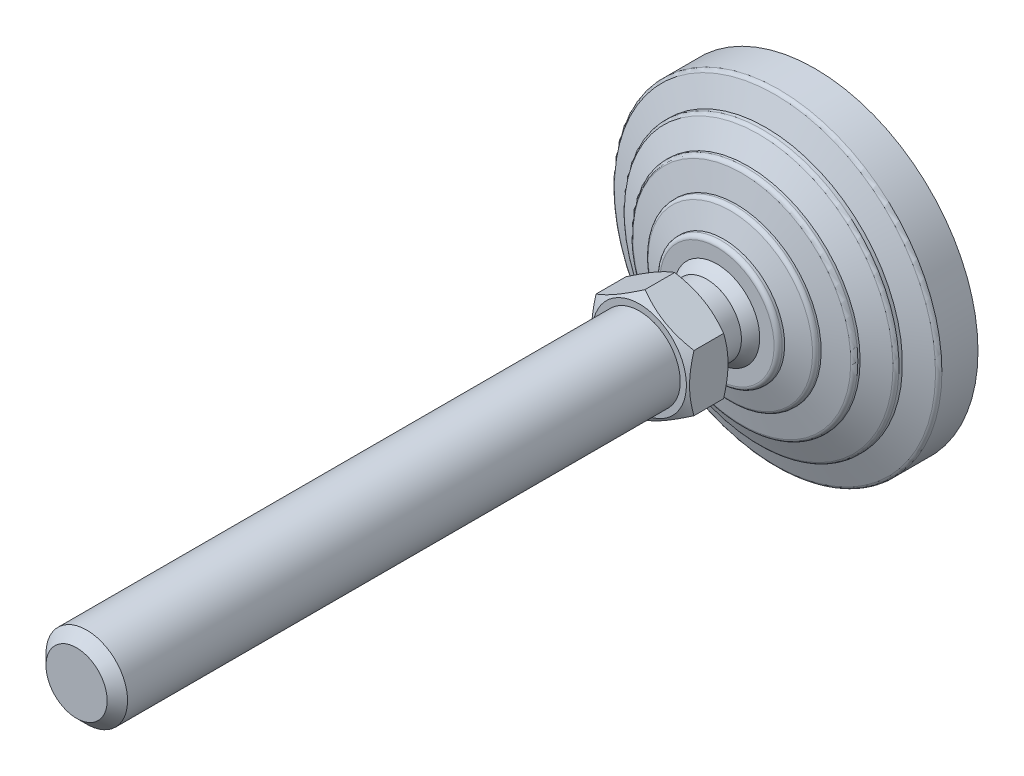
ISO-10303-21;
HEADER;
FILE_DESCRIPTION(('STEP AP214'),'2;1');
FILE_NAME('part.step','',(''),(''),'','','');
FILE_SCHEMA(('AUTOMOTIVE_DESIGN { 1 0 10303 214 1 1 1 1 }'));
ENDSEC;
DATA;
#1=APPLICATION_CONTEXT('core data for automotive mechanical design processes');
#2=APPLICATION_PROTOCOL_DEFINITION('international standard','automotive_design',2000,#1);
#3=PRODUCT_CONTEXT('',#1,'mechanical');
#4=PRODUCT('Part','Part','',(#3));
#5=PRODUCT_RELATED_PRODUCT_CATEGORY('part','',(#4));
#6=PRODUCT_DEFINITION_FORMATION('','',#4);
#7=PRODUCT_DEFINITION_CONTEXT('part definition',#1,'design');
#8=PRODUCT_DEFINITION('design','',#6,#7);
#9=PRODUCT_DEFINITION_SHAPE('','',#8);
#10=(LENGTH_UNIT() NAMED_UNIT(*) SI_UNIT(.MILLI.,.METRE.));
#11=(NAMED_UNIT(*) PLANE_ANGLE_UNIT() SI_UNIT($,.RADIAN.));
#12=(NAMED_UNIT(*) SI_UNIT($,.STERADIAN.) SOLID_ANGLE_UNIT());
#13=UNCERTAINTY_MEASURE_WITH_UNIT(LENGTH_MEASURE(1.E-05),#10,'distance_accuracy_value','');
#14=(GEOMETRIC_REPRESENTATION_CONTEXT(3) GLOBAL_UNCERTAINTY_ASSIGNED_CONTEXT((#13)) GLOBAL_UNIT_ASSIGNED_CONTEXT((#10,
#11,#12)) REPRESENTATION_CONTEXT('',''));
#15=CARTESIAN_POINT('',(0.,0.,0.));
#16=DIRECTION('',(0.,0.,1.));
#17=DIRECTION('',(1.,0.,0.));
#18=AXIS2_PLACEMENT_3D('',#15,#16,#17);
#19=CARTESIAN_POINT('',(-8.49999999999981,0.,32.9999999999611));
#20=DIRECTION('',(0.,0.,1.));
#21=DIRECTION('',(0.,-1.,0.));
#22=AXIS2_PLACEMENT_3D('',#19,#20,#21);
#23=PLANE('',#22);
#24=CARTESIAN_POINT('',(0.,0.,33.000000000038));
#25=DIRECTION('',(0.,0.,-1.));
#26=DIRECTION('',(-1.,0.,0.));
#27=AXIS2_PLACEMENT_3D('',#24,#25,#26);
#28=CIRCLE('',#27,11.5);
#29=CARTESIAN_POINT('',(-11.5,0.,33.000000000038));
#30=VERTEX_POINT('',#29);
#31=EDGE_CURVE('E570',#30,#30,#28,.T.);
#32=ORIENTED_EDGE('',*,*,#31,.T.);
#33=EDGE_LOOP('',(#32));
#34=FACE_BOUND('',#33,.T.);
#35=CARTESIAN_POINT('',(0.,0.,32.9999999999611));
#36=DIRECTION('',(0.,0.,-1.));
#37=DIRECTION('',(0.,1.,0.));
#38=AXIS2_PLACEMENT_3D('',#35,#36,#37);
#39=CIRCLE('',#38,8.49999999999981);
#40=CARTESIAN_POINT('',(0.,8.49999999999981,32.9999999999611));
#41=VERTEX_POINT('',#40);
#42=EDGE_CURVE('E150',#41,#41,#39,.T.);
#43=ORIENTED_EDGE('',*,*,#42,.F.);
#44=EDGE_LOOP('',(#43));
#45=FACE_BOUND('',#44,.T.);
#46=ADVANCED_FACE('F14',(#34,#45),#23,.F.);
#47=CARTESIAN_POINT('',(0.,0.,0.));
#48=DIRECTION('',(0.,0.,-1.));
#49=DIRECTION('',(0.,1.,0.));
#50=AXIS2_PLACEMENT_3D('',#47,#48,#49);
#51=CYLINDRICAL_SURFACE('',#50,8.49999999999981);
#52=CARTESIAN_POINT('',(0.,0.,26.4999999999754));
#53=DIRECTION('',(0.,0.,-1.));
#54=DIRECTION('',(0.,1.,0.));
#55=AXIS2_PLACEMENT_3D('',#52,#53,#54);
#56=CIRCLE('',#55,8.49999999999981);
#57=CARTESIAN_POINT('',(0.,8.49999999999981,26.4999999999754));
#58=VERTEX_POINT('',#57);
#59=EDGE_CURVE('E147',#58,#58,#56,.T.);
#60=ORIENTED_EDGE('',*,*,#59,.F.);
#61=EDGE_LOOP('',(#60));
#62=FACE_BOUND('',#61,.T.);
#63=ORIENTED_EDGE('',*,*,#42,.T.);
#64=EDGE_LOOP('',(#63));
#65=FACE_BOUND('',#64,.T.);
#66=ADVANCED_FACE('F174',(#62,#65),#51,.T.);
#67=CARTESIAN_POINT('',(-8.49107182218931,0.,26.4999999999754));
#68=DIRECTION('',(0.,0.,1.));
#69=DIRECTION('',(0.,-1.,0.));
#70=AXIS2_PLACEMENT_3D('',#67,#68,#69);
#71=PLANE('',#70);
#72=CARTESIAN_POINT('',(0.,0.,26.4999999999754));
#73=DIRECTION('',(0.,0.,-1.));
#74=DIRECTION('',(0.,1.,0.));
#75=AXIS2_PLACEMENT_3D('',#72,#73,#74);
#76=CIRCLE('',#75,8.49107182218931);
#77=CARTESIAN_POINT('',(-8.49107182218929,0.,26.4999999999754));
#78=VERTEX_POINT('',#77);
#79=EDGE_CURVE('E144',#78,#78,#76,.T.);
#80=ORIENTED_EDGE('',*,*,#79,.F.);
#81=EDGE_LOOP('',(#80));
#82=FACE_BOUND('',#81,.T.);
#83=ORIENTED_EDGE('',*,*,#59,.T.);
#84=EDGE_LOOP('',(#83));
#85=FACE_BOUND('',#84,.T.);
#86=ADVANCED_FACE('F181',(#82,#85),#71,.F.);
#87=CARTESIAN_POINT('',(-2.77555756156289E-12,0.,17.6702661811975));
#88=DIRECTION('',(0.,0.,-1.));
#89=DIRECTION('',(-1.,0.,0.));
#90=AXIS2_PLACEMENT_3D('',#87,#88,#89);
#91=SPHERICAL_SURFACE('',#90,12.25);
#92=CARTESIAN_POINT('',(0.,0.,24.));
#93=DIRECTION('',(0.,0.,-1.));
#94=DIRECTION('',(0.,1.,0.));
#95=AXIS2_PLACEMENT_3D('',#92,#93,#94);
#96=CIRCLE('',#95,10.4879440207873);
#97=CARTESIAN_POINT('',(-10.4879440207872,0.,24.));
#98=VERTEX_POINT('',#97);
#99=EDGE_CURVE('E141',#98,#98,#96,.T.);
#100=CARTESIAN_POINT('',(-10.4879440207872,0.,24.));
#101=CARTESIAN_POINT('',(-10.4706730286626,0.,24.0286168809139));
#102=CARTESIAN_POINT('',(-10.4532849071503,0.,24.0571630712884));
#103=CARTESIAN_POINT('',(-10.4182755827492,0.,24.1141121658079));
#104=CARTESIAN_POINT('',(-10.4006543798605,0.,24.1425150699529));
#105=CARTESIAN_POINT('',(-10.3651800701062,0.,24.1991756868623));
#106=CARTESIAN_POINT('',(-10.3473269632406,0.,24.2274333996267));
#107=CARTESIAN_POINT('',(-10.3113900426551,0.,24.283801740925));
#108=CARTESIAN_POINT('',(-10.2933062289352,0.,24.3119123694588));
#109=CARTESIAN_POINT('',(-10.2569091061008,0.,24.367984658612));
#110=CARTESIAN_POINT('',(-10.2385957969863,0.,24.3959463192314));
#111=CARTESIAN_POINT('',(-10.2017409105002,0.,24.4517187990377));
#112=CARTESIAN_POINT('',(-10.1831993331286,0.,24.4795296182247));
#113=CARTESIAN_POINT('',(-10.1458891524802,0.,24.5349985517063));
#114=CARTESIAN_POINT('',(-10.1271205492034,0.,24.5626566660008));
#115=CARTESIAN_POINT('',(-10.0893575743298,0.,24.6178183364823));
#116=CARTESIAN_POINT('',(-10.070363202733,0.,24.6453218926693));
#117=CARTESIAN_POINT('',(-10.0321499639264,0.,24.7001726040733));
#118=CARTESIAN_POINT('',(-10.0129310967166,0.,24.7275197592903));
#119=CARTESIAN_POINT('',(-9.97427015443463,0.,24.7820558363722));
#120=CARTESIAN_POINT('',(-9.95482807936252,0.,24.8092447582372));
#121=CARTESIAN_POINT('',(-9.91572202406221,0.,24.8634625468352));
#122=CARTESIAN_POINT('',(-9.89605804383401,0.,24.8904914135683));
#123=CARTESIAN_POINT('',(-9.85650949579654,0.,24.9443872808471));
#124=CARTESIAN_POINT('',(-9.83662492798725,0.,24.9712542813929));
#125=CARTESIAN_POINT('',(-9.79663653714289,0.,25.0248246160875));
#126=CARTESIAN_POINT('',(-9.77653271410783,0.,25.0515279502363));
#127=CARTESIAN_POINT('',(-9.73610715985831,0.,25.1047691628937));
#128=CARTESIAN_POINT('',(-9.71578542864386,0.,25.1313070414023));
#129=CARTESIAN_POINT('',(-9.67492541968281,0.,25.1842155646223));
#130=CARTESIAN_POINT('',(-9.65438714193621,0.,25.2105862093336));
#131=CARTESIAN_POINT('',(-9.61309541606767,0.,25.2631584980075));
#132=CARTESIAN_POINT('',(-9.59234196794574,0.,25.28936014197));
#133=CARTESIAN_POINT('',(-9.55062129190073,0.,25.3415926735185));
#134=CARTESIAN_POINT('',(-9.52965406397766,0.,25.3676235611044));
#135=CARTESIAN_POINT('',(-9.48750723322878,0.,25.4195128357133));
#136=CARTESIAN_POINT('',(-9.46632763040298,0.,25.4453712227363));
#137=CARTESIAN_POINT('',(-9.42375746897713,0.,25.4969137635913));
#138=CARTESIAN_POINT('',(-9.40236691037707,0.,25.5225979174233));
#139=CARTESIAN_POINT('',(-9.35937627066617,0.,25.5737902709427));
#140=CARTESIAN_POINT('',(-9.33777618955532,0.,25.5992984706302));
#141=CARTESIAN_POINT('',(-9.29436795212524,0.,25.6501372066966));
#142=CARTESIAN_POINT('',(-9.27255979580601,0.,25.6754677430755));
#143=CARTESIAN_POINT('',(-9.22873686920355,0.,25.7259494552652));
#144=CARTESIAN_POINT('',(-9.20672209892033,0.,25.751100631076));
#145=CARTESIAN_POINT('',(-9.16248741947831,0.,25.8012219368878));
#146=CARTESIAN_POINT('',(-9.14026751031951,0.,25.8261920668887));
#147=CARTESIAN_POINT('',(-9.0956240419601,0.,25.87594960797));
#148=CARTESIAN_POINT('',(-9.07320048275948,0.,25.9007370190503));
#149=CARTESIAN_POINT('',(-9.0281512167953,0.,25.9501274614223));
#150=CARTESIAN_POINT('',(-9.00552551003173,0.,25.9747304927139));
#151=CARTESIAN_POINT('',(-8.96007346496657,0.,26.023750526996));
#152=CARTESIAN_POINT('',(-8.93724712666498,0.,26.0481675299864));
#153=CARTESIAN_POINT('',(-8.8913953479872,0.,26.0968138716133));
#154=CARTESIAN_POINT('',(-8.868369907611,0.,26.1210432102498));
#155=CARTESIAN_POINT('',(-8.82212146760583,0.,26.1693125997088));
#156=CARTESIAN_POINT('',(-8.79889846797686,0.,26.1933526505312));
#157=CARTESIAN_POINT('',(-8.75225646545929,0.,26.2412418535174));
#158=CARTESIAN_POINT('',(-8.72883746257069,0.,26.2650910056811));
#159=CARTESIAN_POINT('',(-8.68180502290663,0.,26.3125968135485));
#160=CARTESIAN_POINT('',(-8.65819158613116,0.,26.3362534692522));
#161=CARTESIAN_POINT('',(-8.61077186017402,0.,26.383372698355));
#162=CARTESIAN_POINT('',(-8.58696557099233,0.,26.4068352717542));
#163=CARTESIAN_POINT('',(-8.53916173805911,0.,26.4535647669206));
#164=CARTESIAN_POINT('',(-8.51516419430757,0.,26.4768316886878));
#165=CARTESIAN_POINT('',(-8.49107182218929,0.,26.4999999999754));
#166=B_SPLINE_CURVE_WITH_KNOTS('',3,(#100,#101,#102,#103,#104,#105,#106,#107,#108,#109,#110,
#111,#112,#113,#114,#115,#116,#117,#118,#119,#120,#121,#122,#123,#124,#125,#126,#127,#128,#129,
#130,#131,#132,#133,#134,#135,#136,#137,#138,#139,#140,#141,#142,#143,#144,#145,#146,#147,#148,
#149,#150,#151,#152,#153,#154,#155,#156,#157,#158,#159,#160,#161,#162,#163,#164,#165),
.UNSPECIFIED.,.F.,.F.,(4,2,2,2,2,2,2,2,2,2,2,2,2,2,2,2,2,2,2,2,2,2,2,2,2,2,2,2,2,2,2,2,4),(0.,
0.100273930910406,0.20054786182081,0.30082179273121,0.401095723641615,0.501369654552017,
0.601643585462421,0.701917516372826,0.802191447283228,0.90246537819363,1.00273930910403,
1.10301324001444,1.20328717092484,1.30356110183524,1.40383503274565,1.50410896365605,
1.60438289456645,1.70465682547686,1.80493075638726,1.90520468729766,2.00547861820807,
2.10575254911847,2.20602648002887,2.30630041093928,2.40657434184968,2.50684827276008,
2.60712220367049,2.70739613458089,2.80767006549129,2.90794399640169,3.0082179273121,
3.1084918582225,3.2087657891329),.UNSPECIFIED.);
#167=EDGE_CURVE('BSEAM433',#98,#78,#166,.T.);
#168=ORIENTED_EDGE('',*,*,#99,.F.);
#169=ORIENTED_EDGE('',*,*,#79,.T.);
#170=ORIENTED_EDGE('',*,*,#167,.T.);
#171=ORIENTED_EDGE('',*,*,#167,.F.);
#172=EDGE_LOOP('',(#168,#170,#169,#171));
#173=FACE_BOUND('',#172,.T.);
#174=ADVANCED_FACE('F433',(#173),#91,.T.);
#175=CARTESIAN_POINT('',(-10.4879440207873,0.,24.));
#176=DIRECTION('',(0.,0.,-1.));
#177=DIRECTION('',(0.,1.,0.));
#178=AXIS2_PLACEMENT_3D('',#175,#176,#177);
#179=PLANE('',#178);
#180=CARTESIAN_POINT('',(0.,0.,24.));
#181=DIRECTION('',(0.,0.,-1.));
#182=DIRECTION('',(0.,1.,0.));
#183=AXIS2_PLACEMENT_3D('',#180,#181,#182);
#184=CIRCLE('',#183,13.9999999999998);
#185=CARTESIAN_POINT('',(0.,13.9999999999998,24.));
#186=VERTEX_POINT('',#185);
#187=EDGE_CURVE('E138',#186,#186,#184,.T.);
#188=ORIENTED_EDGE('',*,*,#187,.F.);
#189=EDGE_LOOP('',(#188));
#190=FACE_BOUND('',#189,.T.);
#191=ORIENTED_EDGE('',*,*,#99,.T.);
#192=EDGE_LOOP('',(#191));
#193=FACE_BOUND('',#192,.T.);
#194=ADVANCED_FACE('F423',(#190,#193),#179,.F.);
#195=CARTESIAN_POINT('',(0.,0.,23.));
#196=DIRECTION('',(0.,0.,-1.));
#197=DIRECTION('',(0.,1.,0.));
#198=AXIS2_PLACEMENT_3D('',#195,#196,#197);
#199=TOROIDAL_SURFACE('',#198,13.9999999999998,1.);
#200=CARTESIAN_POINT('',(0.,0.,23.));
#201=DIRECTION('',(0.,0.,-1.));
#202=DIRECTION('',(0.,1.,0.));
#203=AXIS2_PLACEMENT_3D('',#200,#201,#202);
#204=CIRCLE('',#203,14.9999999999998);
#205=CARTESIAN_POINT('',(0.,14.9999999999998,23.));
#206=VERTEX_POINT('',#205);
#207=EDGE_CURVE('E135',#206,#206,#204,.T.);
#208=ORIENTED_EDGE('',*,*,#207,.F.);
#209=EDGE_LOOP('',(#208));
#210=FACE_BOUND('',#209,.T.);
#211=ORIENTED_EDGE('',*,*,#187,.T.);
#212=EDGE_LOOP('',(#211));
#213=FACE_BOUND('',#212,.T.);
#214=ADVANCED_FACE('F413',(#210,#213),#199,.T.);
#215=CARTESIAN_POINT('',(0.,0.,0.));
#216=DIRECTION('',(0.,0.,-1.));
#217=DIRECTION('',(0.,1.,0.));
#218=AXIS2_PLACEMENT_3D('',#215,#216,#217);
#219=CYLINDRICAL_SURFACE('',#218,14.9999999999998);
#220=CARTESIAN_POINT('',(0.,0.,22.4025287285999));
#221=DIRECTION('',(0.,0.,-1.));
#222=DIRECTION('',(0.,1.,0.));
#223=AXIS2_PLACEMENT_3D('',#220,#221,#222);
#224=CIRCLE('',#223,14.9999999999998);
#225=CARTESIAN_POINT('',(0.,14.9999999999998,22.4025287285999));
#226=VERTEX_POINT('',#225);
#227=EDGE_CURVE('E132',#226,#226,#224,.T.);
#228=ORIENTED_EDGE('',*,*,#227,.F.);
#229=EDGE_LOOP('',(#228));
#230=FACE_BOUND('',#229,.T.);
#231=ORIENTED_EDGE('',*,*,#207,.T.);
#232=EDGE_LOOP('',(#231));
#233=FACE_BOUND('',#232,.T.);
#234=ADVANCED_FACE('F403',(#230,#233),#219,.T.);
#235=CARTESIAN_POINT('',(0.,0.,22.4025287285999));
#236=DIRECTION('',(0.,0.,-1.));
#237=DIRECTION('',(0.,1.,0.));
#238=AXIS2_PLACEMENT_3D('',#235,#236,#237);
#239=CONICAL_SURFACE('',#238,14.9999999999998,1.25589726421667);
#240=CARTESIAN_POINT('',(0.,0.,20.7216684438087));
#241=DIRECTION('',(0.,0.,-1.));
#242=DIRECTION('',(0.,1.,0.));
#243=AXIS2_PLACEMENT_3D('',#240,#241,#242);
#244=CIRCLE('',#243,20.1601635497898);
#245=CARTESIAN_POINT('',(0.,20.1601635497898,20.7216684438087));
#246=VERTEX_POINT('',#245);
#247=EDGE_CURVE('E129',#246,#246,#244,.T.);
#248=ORIENTED_EDGE('',*,*,#247,.F.);
#249=EDGE_LOOP('',(#248));
#250=FACE_BOUND('',#249,.T.);
#251=ORIENTED_EDGE('',*,*,#227,.T.);
#252=EDGE_LOOP('',(#251));
#253=FACE_BOUND('',#252,.T.);
#254=ADVANCED_FACE('F393',(#250,#253),#239,.T.);
#255=CARTESIAN_POINT('',(0.,0.,19.7708407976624));
#256=DIRECTION('',(0.,0.,-1.));
#257=DIRECTION('',(0.,1.,0.));
#258=AXIS2_PLACEMENT_3D('',#255,#256,#257);
#259=TOROIDAL_SURFACE('',#258,19.8504430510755,1.);
#260=CARTESIAN_POINT('',(0.,0.,19.7708407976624));
#261=DIRECTION('',(0.,0.,-1.));
#262=DIRECTION('',(0.,1.,0.));
#263=AXIS2_PLACEMENT_3D('',#260,#261,#262);
#264=CIRCLE('',#263,20.8504430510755);
#265=CARTESIAN_POINT('',(0.,20.8504430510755,19.7708407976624));
#266=VERTEX_POINT('',#265);
#267=EDGE_CURVE('E126',#266,#266,#264,.T.);
#268=ORIENTED_EDGE('',*,*,#267,.F.);
#269=EDGE_LOOP('',(#268));
#270=FACE_BOUND('',#269,.T.);
#271=ORIENTED_EDGE('',*,*,#247,.T.);
#272=EDGE_LOOP('',(#271));
#273=FACE_BOUND('',#272,.T.);
#274=ADVANCED_FACE('F383',(#270,#273),#259,.T.);
#275=CARTESIAN_POINT('',(0.,0.,0.));
#276=DIRECTION('',(0.,0.,-1.));
#277=DIRECTION('',(0.,1.,0.));
#278=AXIS2_PLACEMENT_3D('',#275,#276,#277);
#279=CYLINDRICAL_SURFACE('',#278,20.8504430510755);
#280=CARTESIAN_POINT('',(0.,0.,19.2987385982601));
#281=DIRECTION('',(0.,0.,-1.));
#282=DIRECTION('',(0.,1.,0.));
#283=AXIS2_PLACEMENT_3D('',#280,#281,#282);
#284=CIRCLE('',#283,20.8504430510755);
#285=CARTESIAN_POINT('',(0.,20.8504430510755,19.2987385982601));
#286=VERTEX_POINT('',#285);
#287=EDGE_CURVE('E123',#286,#286,#284,.T.);
#288=ORIENTED_EDGE('',*,*,#287,.F.);
#289=EDGE_LOOP('',(#288));
#290=FACE_BOUND('',#289,.T.);
#291=ORIENTED_EDGE('',*,*,#267,.T.);
#292=EDGE_LOOP('',(#291));
#293=FACE_BOUND('',#292,.T.);
#294=ADVANCED_FACE('F373',(#290,#293),#279,.T.);
#295=CARTESIAN_POINT('',(0.,0.,19.2987385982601));
#296=DIRECTION('',(0.,0.,-1.));
#297=DIRECTION('',(0.,1.,0.));
#298=AXIS2_PLACEMENT_3D('',#295,#296,#297);
#299=CONICAL_SURFACE('',#298,20.8504430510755,1.34067144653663);
#300=CARTESIAN_POINT('',(0.,0.,17.9217501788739));
#301=DIRECTION('',(0.,0.,-1.));
#302=DIRECTION('',(0.,1.,0.));
#303=AXIS2_PLACEMENT_3D('',#300,#301,#302);
#304=CIRCLE('',#303,26.7280991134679);
#305=CARTESIAN_POINT('',(0.,26.7280991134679,17.9217501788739));
#306=VERTEX_POINT('',#305);
#307=EDGE_CURVE('E120',#306,#306,#304,.T.);
#308=ORIENTED_EDGE('',*,*,#307,.F.);
#309=EDGE_LOOP('',(#308));
#310=FACE_BOUND('',#309,.T.);
#311=ORIENTED_EDGE('',*,*,#287,.T.);
#312=EDGE_LOOP('',(#311));
#313=FACE_BOUND('',#312,.T.);
#314=ADVANCED_FACE('F363',(#310,#313),#299,.T.);
#315=CARTESIAN_POINT('',(0.,0.,16.9481122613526));
#316=DIRECTION('',(0.,0.,-1.));
#317=DIRECTION('',(0.,1.,0.));
#318=AXIS2_PLACEMENT_3D('',#315,#316,#317);
#319=TOROIDAL_SURFACE('',#318,26.5,1.00000000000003);
#320=CARTESIAN_POINT('',(0.,0.,16.9481122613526));
#321=DIRECTION('',(0.,0.,-1.));
#322=DIRECTION('',(0.,1.,0.));
#323=AXIS2_PLACEMENT_3D('',#320,#321,#322);
#324=CIRCLE('',#323,27.5);
#325=CARTESIAN_POINT('',(0.,27.5,16.9481122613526));
#326=VERTEX_POINT('',#325);
#327=EDGE_CURVE('E117',#326,#326,#324,.T.);
#328=ORIENTED_EDGE('',*,*,#327,.F.);
#329=EDGE_LOOP('',(#328));
#330=FACE_BOUND('',#329,.T.);
#331=ORIENTED_EDGE('',*,*,#307,.T.);
#332=EDGE_LOOP('',(#331));
#333=FACE_BOUND('',#332,.T.);
#334=ADVANCED_FACE('F353',(#330,#333),#319,.T.);
#335=CARTESIAN_POINT('',(0.,0.,0.));
#336=DIRECTION('',(0.,0.,-1.));
#337=DIRECTION('',(0.,1.,0.));
#338=AXIS2_PLACEMENT_3D('',#335,#336,#337);
#339=CYLINDRICAL_SURFACE('',#338,27.5);
#340=CARTESIAN_POINT('',(0.,0.,16.4025287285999));
#341=DIRECTION('',(0.,0.,-1.));
#342=DIRECTION('',(0.,1.,0.));
#343=AXIS2_PLACEMENT_3D('',#340,#341,#342);
#344=CIRCLE('',#343,27.5);
#345=CARTESIAN_POINT('',(0.,27.5,16.4025287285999));
#346=VERTEX_POINT('',#345);
#347=EDGE_CURVE('E114',#346,#346,#344,.T.);
#348=ORIENTED_EDGE('',*,*,#347,.F.);
#349=EDGE_LOOP('',(#348));
#350=FACE_BOUND('',#349,.T.);
#351=ORIENTED_EDGE('',*,*,#327,.T.);
#352=EDGE_LOOP('',(#351));
#353=FACE_BOUND('',#352,.T.);
#354=ADVANCED_FACE('F343',(#350,#353),#339,.T.);
#355=CARTESIAN_POINT('',(0.,0.,16.4025287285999));
#356=DIRECTION('',(0.,0.,-1.));
#357=DIRECTION('',(0.,1.,0.));
#358=AXIS2_PLACEMENT_3D('',#355,#356,#357);
#359=CONICAL_SURFACE('',#358,27.5,1.1202291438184);
#360=CARTESIAN_POINT('',(0.,0.,13.7730910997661));
#361=DIRECTION('',(0.,0.,-1.));
#362=DIRECTION('',(0.,1.,0.));
#363=AXIS2_PLACEMENT_3D('',#360,#361,#362);
#364=CIRCLE('',#363,32.935476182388);
#365=CARTESIAN_POINT('',(0.,32.935476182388,13.7730910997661));
#366=VERTEX_POINT('',#365);
#367=EDGE_CURVE('E111',#366,#366,#364,.T.);
#368=ORIENTED_EDGE('',*,*,#367,.F.);
#369=EDGE_LOOP('',(#368));
#370=FACE_BOUND('',#369,.T.);
#371=ORIENTED_EDGE('',*,*,#347,.T.);
#372=EDGE_LOOP('',(#371));
#373=FACE_BOUND('',#372,.T.);
#374=ADVANCED_FACE('F333',(#370,#373),#359,.T.);
#375=CARTESIAN_POINT('',(0.,0.,12.8728908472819));
#376=DIRECTION('',(0.,0.,-1.));
#377=DIRECTION('',(0.,1.,0.));
#378=AXIS2_PLACEMENT_3D('',#375,#376,#377);
#379=TOROIDAL_SURFACE('',#378,32.5,0.999999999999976);
#380=CARTESIAN_POINT('',(0.,0.,12.8728908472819));
#381=DIRECTION('',(0.,0.,-1.));
#382=DIRECTION('',(0.,1.,0.));
#383=AXIS2_PLACEMENT_3D('',#380,#381,#382);
#384=CIRCLE('',#383,33.5);
#385=CARTESIAN_POINT('',(0.,33.5,12.8728908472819));
#386=VERTEX_POINT('',#385);
#387=EDGE_CURVE('E108',#386,#386,#384,.T.);
#388=ORIENTED_EDGE('',*,*,#387,.F.);
#389=EDGE_LOOP('',(#388));
#390=FACE_BOUND('',#389,.T.);
#391=ORIENTED_EDGE('',*,*,#367,.T.);
#392=EDGE_LOOP('',(#391));
#393=FACE_BOUND('',#392,.T.);
#394=ADVANCED_FACE('F323',(#390,#393),#379,.T.);
#395=CARTESIAN_POINT('',(0.,0.,0.));
#396=DIRECTION('',(0.,0.,-1.));
#397=DIRECTION('',(0.,1.,0.));
#398=AXIS2_PLACEMENT_3D('',#395,#396,#397);
#399=CYLINDRICAL_SURFACE('',#398,33.5);
#400=CARTESIAN_POINT('',(0.,0.,12.0315037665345));
#401=DIRECTION('',(0.,0.,-1.));
#402=DIRECTION('',(0.,1.,0.));
#403=AXIS2_PLACEMENT_3D('',#400,#401,#402);
#404=CIRCLE('',#403,33.5);
#405=CARTESIAN_POINT('',(0.,33.5,12.0315037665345));
#406=VERTEX_POINT('',#405);
#407=EDGE_CURVE('E105',#406,#406,#404,.T.);
#408=ORIENTED_EDGE('',*,*,#407,.F.);
#409=EDGE_LOOP('',(#408));
#410=FACE_BOUND('',#409,.T.);
#411=ORIENTED_EDGE('',*,*,#387,.T.);
#412=EDGE_LOOP('',(#411));
#413=FACE_BOUND('',#412,.T.);
#414=ADVANCED_FACE('F313',(#410,#413),#399,.T.);
#415=CARTESIAN_POINT('',(0.,0.,12.0315037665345));
#416=DIRECTION('',(0.,0.,-1.));
#417=DIRECTION('',(0.,1.,0.));
#418=AXIS2_PLACEMENT_3D('',#415,#416,#417);
#419=CONICAL_SURFACE('',#418,33.5,1.20362249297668);
#420=CARTESIAN_POINT('',(0.,0.,9.77805027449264));
#421=DIRECTION('',(0.,0.,-1.));
#422=DIRECTION('',(0.,1.,0.));
#423=AXIS2_PLACEMENT_3D('',#420,#421,#422);
#424=CIRCLE('',#423,39.3589790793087);
#425=CARTESIAN_POINT('',(0.,39.3589790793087,9.77805027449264));
#426=VERTEX_POINT('',#425);
#427=EDGE_CURVE('E102',#426,#426,#424,.T.);
#428=ORIENTED_EDGE('',*,*,#427,.F.);
#429=EDGE_LOOP('',(#428));
#430=FACE_BOUND('',#429,.T.);
#431=ORIENTED_EDGE('',*,*,#407,.T.);
#432=EDGE_LOOP('',(#431));
#433=FACE_BOUND('',#432,.T.);
#434=ADVANCED_FACE('F303',(#430,#433),#419,.T.);
#435=CARTESIAN_POINT('',(0.,0.,8.84470466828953));
#436=DIRECTION('',(0.,0.,-1.));
#437=DIRECTION('',(0.,1.,0.));
#438=AXIS2_PLACEMENT_3D('',#435,#436,#437);
#439=TOROIDAL_SURFACE('',#438,39.,1.00000000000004);
#440=CARTESIAN_POINT('',(0.,0.,8.84470466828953));
#441=DIRECTION('',(0.,0.,-1.));
#442=DIRECTION('',(0.,1.,0.));
#443=AXIS2_PLACEMENT_3D('',#440,#441,#442);
#444=CIRCLE('',#443,40.);
#445=CARTESIAN_POINT('',(0.,40.,8.84470466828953));
#446=VERTEX_POINT('',#445);
#447=EDGE_CURVE('E99',#446,#446,#444,.T.);
#448=ORIENTED_EDGE('',*,*,#447,.F.);
#449=EDGE_LOOP('',(#448));
#450=FACE_BOUND('',#449,.T.);
#451=ORIENTED_EDGE('',*,*,#427,.T.);
#452=EDGE_LOOP('',(#451));
#453=FACE_BOUND('',#452,.T.);
#454=ADVANCED_FACE('F293',(#450,#453),#439,.T.);
#455=CARTESIAN_POINT('',(0.,0.,0.));
#456=DIRECTION('',(0.,0.,-1.));
#457=DIRECTION('',(0.,1.,0.));
#458=AXIS2_PLACEMENT_3D('',#455,#456,#457);
#459=CYLINDRICAL_SURFACE('',#458,40.);
#460=CARTESIAN_POINT('',(0.,0.,0.));
#461=DIRECTION('',(0.,0.,-1.));
#462=DIRECTION('',(0.,1.,0.));
#463=AXIS2_PLACEMENT_3D('',#460,#461,#462);
#464=CIRCLE('',#463,40.);
#465=CARTESIAN_POINT('',(0.,40.,0.));
#466=VERTEX_POINT('',#465);
#467=EDGE_CURVE('E96',#466,#466,#464,.T.);
#468=ORIENTED_EDGE('',*,*,#467,.F.);
#469=EDGE_LOOP('',(#468));
#470=FACE_BOUND('',#469,.T.);
#471=ORIENTED_EDGE('',*,*,#447,.T.);
#472=EDGE_LOOP('',(#471));
#473=FACE_BOUND('',#472,.T.);
#474=ADVANCED_FACE('F282',(#470,#473),#459,.T.);
#475=CARTESIAN_POINT('',(0.,0.,0.));
#476=DIRECTION('',(0.,0.,1.));
#477=DIRECTION('',(0.,-1.,0.));
#478=AXIS2_PLACEMENT_3D('',#475,#476,#477);
#479=PLANE('',#478);
#480=ORIENTED_EDGE('',*,*,#467,.T.);
#481=EDGE_LOOP('',(#480));
#482=FACE_BOUND('',#481,.T.);
#483=ADVANCED_FACE('F172',(#482),#479,.F.);
#484=CARTESIAN_POINT('',(0.,0.,35.8960538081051));
#485=DIRECTION('',(0.,0.,1.));
#486=DIRECTION('',(1.,0.,0.));
#487=AXIS2_PLACEMENT_3D('',#484,#485,#486);
#488=CONICAL_SURFACE('',#487,16.5161123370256,1.0471975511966);
#489=CARTESIAN_POINT('',(0.000200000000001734,-13.8565219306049,34.3605385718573));
#490=CARTESIAN_POINT('',(-0.263585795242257,-13.7042251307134,34.2726247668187));
#491=CARTESIAN_POINT('',(-0.528355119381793,-13.5513604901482,34.1887011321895));
#492=CARTESIAN_POINT('',(-1.06001701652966,-13.2444053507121,34.0299413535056));
#493=CARTESIAN_POINT('',(-1.32691025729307,-13.0903144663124,33.9551081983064));
#494=CARTESIAN_POINT('',(-2.13189040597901,-12.6255589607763,33.745692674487));
#495=CARTESIAN_POINT('',(-2.6731550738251,-12.3130596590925,33.6265783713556));
#496=CARTESIAN_POINT('',(-3.48313282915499,-11.8454187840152,33.4869061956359));
#497=CARTESIAN_POINT('',(-3.74942610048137,-11.6916742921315,33.4471189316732));
#498=CARTESIAN_POINT('',(-4.28324559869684,-11.3834734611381,33.3803985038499));
#499=CARTESIAN_POINT('',(-4.55077184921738,-11.2290171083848,33.3534655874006));
#500=CARTESIAN_POINT('',(-5.08627036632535,-10.9198468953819,33.3131437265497));
#501=CARTESIAN_POINT('',(-5.35424172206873,-10.7651335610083,33.2997386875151));
#502=CARTESIAN_POINT('',(-5.89043273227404,-10.4555635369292,33.28675822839));
#503=CARTESIAN_POINT('',(-6.15865237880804,-10.3007068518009,33.2871823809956));
#504=CARTESIAN_POINT('',(-6.66008937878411,-10.0112020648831,33.3008951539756));
#505=CARTESIAN_POINT('',(-6.89334249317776,-9.87653331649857,33.3125111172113));
#506=CARTESIAN_POINT('',(-7.35931224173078,-9.60750555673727,33.3459831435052));
#507=CARTESIAN_POINT('',(-7.59202883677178,-9.47314656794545,33.367839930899));
#508=CARTESIAN_POINT('',(-8.05679907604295,-9.20481134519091,33.4214125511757));
#509=CARTESIAN_POINT('',(-8.28885201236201,-9.07083551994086,33.4531365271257));
#510=CARTESIAN_POINT('',(-8.75186996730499,-8.8035119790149,33.5258869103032));
#511=CARTESIAN_POINT('',(-8.98283491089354,-8.67016430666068,33.566913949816));
#512=CARTESIAN_POINT('',(-9.68394195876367,-8.26537996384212,33.7049867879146));
#513=CARTESIAN_POINT('',(-10.1520537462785,-7.99511549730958,33.8158000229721));
#514=CARTESIAN_POINT('',(-11.0812971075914,-7.45861659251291,34.0673009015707));
#515=CARTESIAN_POINT('',(-11.5424405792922,-7.19237528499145,34.2079294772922));
#516=CARTESIAN_POINT('',(-12.0002,-6.92808776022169,34.3605385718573));
#517=B_SPLINE_CURVE_WITH_KNOTS('',3,(#489,#490,#491,#492,#493,#494,#495,#496,#497,#498,#499,
#500,#501,#502,#503,#504,#505,#506,#507,#508,#509,#510,#511,#512,#513,#514,#515,#516),
.UNSPECIFIED.,.F.,.F.,(4,2,2,2,2,2,2,2,2,2,2,2,2,4),(0.,0.951004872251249,1.90232158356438,
3.80900466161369,4.73894551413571,5.6689042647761,6.59775529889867,7.52657763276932,
8.3351464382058,9.14377244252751,9.95306755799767,10.7624176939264,12.4167102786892,
14.0677556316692),.UNSPECIFIED.);
#518=CARTESIAN_POINT('',(0.,-13.856406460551,34.3604719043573));
#519=VERTEX_POINT('',#518);
#520=CARTESIAN_POINT('',(-12.,-6.92820323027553,34.3604719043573));
#521=VERTEX_POINT('',#520);
#522=EDGE_CURVE('E73',#519,#521,#517,.T.);
#523=ORIENTED_EDGE('',*,*,#522,.T.);
#524=CARTESIAN_POINT('',(-12.,-18.5481289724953,39.1149885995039));
#525=CARTESIAN_POINT('',(-12.,-18.2863348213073,38.9880872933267));
#526=CARTESIAN_POINT('',(-12.,-18.0242317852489,38.8618235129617));
#527=CARTESIAN_POINT('',(-12.,-17.4993434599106,38.6107155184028));
#528=CARTESIAN_POINT('',(-12.,-17.2365581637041,38.485871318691));
#529=CARTESIAN_POINT('',(-12.,-16.4470113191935,38.1136515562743));
#530=CARTESIAN_POINT('',(-12.,-15.9191372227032,37.8686269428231));
#531=CARTESIAN_POINT('',(-12.,-14.8569332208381,37.3850079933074));
#532=CARTESIAN_POINT('',(-12.,-14.3225837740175,37.1464564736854));
#533=CARTESIAN_POINT('',(-12.,-13.2496136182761,36.6791950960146));
#534=CARTESIAN_POINT('',(-12.,-12.710993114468,36.4504847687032));
#535=CARTESIAN_POINT('',(-12.,-11.6114870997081,35.998466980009));
#536=CARTESIAN_POINT('',(-12.,-11.0504363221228,35.7755594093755));
#537=CARTESIAN_POINT('',(-12.,-9.92174404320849,35.3467643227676));
#538=CARTESIAN_POINT('',(-12.,-9.35410180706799,35.1408787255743));
#539=CARTESIAN_POINT('',(-12.,-8.21242481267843,34.7515808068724));
#540=CARTESIAN_POINT('',(-12.,-7.63840587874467,34.5681224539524));
#541=CARTESIAN_POINT('',(-12.,-6.48207984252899,34.229596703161));
#542=CARTESIAN_POINT('',(-12.,-5.89977543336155,34.0745202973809));
#543=CARTESIAN_POINT('',(-12.,-5.0216126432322,33.8692563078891));
#544=CARTESIAN_POINT('',(-12.,-4.72889961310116,33.8055282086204));
#545=CARTESIAN_POINT('',(-12.,-4.14148516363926,33.6879546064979));
#546=CARTESIAN_POINT('',(-12.,-3.84678378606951,33.6341088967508));
#547=CARTESIAN_POINT('',(-12.,-3.25560003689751,33.5372542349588));
#548=CARTESIAN_POINT('',(-12.,-2.95911768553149,33.4942451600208));
#549=CARTESIAN_POINT('',(-12.,-2.36469164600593,33.419924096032));
#550=CARTESIAN_POINT('',(-12.,-2.06674801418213,33.3886116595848));
#551=CARTESIAN_POINT('',(-12.,-1.47367884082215,33.3386950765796));
#552=CARTESIAN_POINT('',(-12.,-1.17856679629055,33.319931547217));
#553=CARTESIAN_POINT('',(-12.,-0.587814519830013,33.2948970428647));
#554=CARTESIAN_POINT('',(-12.,-0.292174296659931,33.2886258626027));
#555=CARTESIAN_POINT('',(-12.,0.299107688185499,33.28872498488));
#556=CARTESIAN_POINT('',(-12.,0.594749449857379,33.2950953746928));
#557=CARTESIAN_POINT('',(-12.,1.18550327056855,33.3203233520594));
#558=CARTESIAN_POINT('',(-12.,1.48061530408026,33.3391815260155));
#559=CARTESIAN_POINT('',(-12.,2.1917374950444,33.3992719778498));
#560=CARTESIAN_POINT('',(-12.,2.60724700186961,33.4465333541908));
#561=CARTESIAN_POINT('',(-12.,3.43514384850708,33.5632229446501));
#562=CARTESIAN_POINT('',(-12.,3.84753074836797,33.6326542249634));
#563=CARTESIAN_POINT('',(-12.,4.66880212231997,33.7912136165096));
#564=CARTESIAN_POINT('',(-12.,5.07768356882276,33.8803572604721));
#565=CARTESIAN_POINT('',(-12.,5.8913262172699,34.0756248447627));
#566=CARTESIAN_POINT('',(-12.,6.29608748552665,34.1817485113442));
#567=CARTESIAN_POINT('',(-12.,7.11037027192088,34.4109001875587));
#568=CARTESIAN_POINT('',(-12.,7.51980108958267,34.5342482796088));
#569=CARTESIAN_POINT('',(-12.,8.33462859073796,34.7935509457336));
#570=CARTESIAN_POINT('',(-12.,8.74002524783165,34.9295056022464));
#571=CARTESIAN_POINT('',(-12.,9.54698737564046,35.2118747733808));
#572=CARTESIAN_POINT('',(-12.,9.94855410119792,35.358285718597));
#573=CARTESIAN_POINT('',(-12.,10.748369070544,35.6598585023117));
#574=CARTESIAN_POINT('',(-12.,11.1466173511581,35.8150202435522));
#575=CARTESIAN_POINT('',(-12.,12.0781957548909,36.1878835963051));
#576=CARTESIAN_POINT('',(-12.,12.6103306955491,36.4085666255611));
#577=CARTESIAN_POINT('',(-12.,13.6701510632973,36.8603999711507));
#578=CARTESIAN_POINT('',(-12.,14.1978362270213,37.0915509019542));
#579=CARTESIAN_POINT('',(-12.,15.2495756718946,37.5622454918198));
#580=CARTESIAN_POINT('',(-12.,15.7736291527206,37.8017909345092));
#581=CARTESIAN_POINT('',(-12.,16.8185924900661,38.2875996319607));
#582=CARTESIAN_POINT('',(-12.,17.3395024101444,38.5338627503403));
#583=CARTESIAN_POINT('',(-12.,18.379244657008,39.0321267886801));
#584=CARTESIAN_POINT('',(-12.,18.8980741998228,39.284133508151));
#585=CARTESIAN_POINT('',(-12.,19.9335164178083,39.7926599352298));
#586=CARTESIAN_POINT('',(-12.,20.4501290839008,40.049179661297));
#587=CARTESIAN_POINT('',(-12.,21.4814114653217,40.5659337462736));
#588=CARTESIAN_POINT('',(-12.,21.9960814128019,40.8261676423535));
#589=CARTESIAN_POINT('',(-12.,23.0238205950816,41.3497790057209));
#590=CARTESIAN_POINT('',(-12.,23.5368898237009,41.6131564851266));
#591=CARTESIAN_POINT('',(-12.,24.9894708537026,42.3635636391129));
#592=CARTESIAN_POINT('',(-12.,25.9273655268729,42.8537236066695));
#593=CARTESIAN_POINT('',(-12.,27.7996715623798,43.8407123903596));
#594=CARTESIAN_POINT('',(-12.,28.7340828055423,44.3375414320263));
#595=CARTESIAN_POINT('',(-12.,30.5979127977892,45.3351082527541));
#596=CARTESIAN_POINT('',(-12.,31.5273381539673,45.8358336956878));
#597=CARTESIAN_POINT('',(-12.,32.9198291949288,46.589900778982));
#598=CARTESIAN_POINT('',(-12.,33.3837062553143,46.8417463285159));
#599=CARTESIAN_POINT('',(-12.,34.3109729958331,47.346331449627));
#600=CARTESIAN_POINT('',(-12.,34.7743626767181,47.5990710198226));
#601=CARTESIAN_POINT('',(-12.,35.2375361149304,47.852206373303));
#602=B_SPLINE_CURVE_WITH_KNOTS('',3,(#524,#525,#526,#527,#528,#529,#530,#531,#532,#533,#534,
#535,#536,#537,#538,#539,#540,#541,#542,#543,#544,#545,#546,#547,#548,#549,#550,#551,#552,#553,
#554,#555,#556,#557,#558,#559,#560,#561,#562,#563,#564,#565,#566,#567,#568,#569,#570,#571,#572,
#573,#574,#575,#576,#577,#578,#579,#580,#581,#582,#583,#584,#585,#586,#587,#588,#589,#590,#591,
#592,#593,#594,#595,#596,#597,#598,#599,#600,#601),.UNSPECIFIED.,.F.,.F.,(4,2,2,2,2,2,2,2,2,2,2,
2,2,2,2,2,2,2,2,2,2,2,2,2,2,2,2,2,2,2,2,2,2,2,2,2,2,2,4),(0.,0.872787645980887,1.74558418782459,
3.49143879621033,5.24690285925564,7.00228312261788,8.81320225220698,10.6243252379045,
12.4316661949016,14.2384325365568,15.1370027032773,16.0355540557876,16.9340952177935,
17.8326020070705,18.7194684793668,19.6063203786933,20.4931784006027,21.3800780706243,
22.6339490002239,23.8879934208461,25.1430295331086,26.3980454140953,27.6806255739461,
28.9632141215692,30.2453669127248,31.5275054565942,33.2555953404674,34.9837867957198,
36.7123477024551,38.4408735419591,40.1712296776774,41.9015928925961,43.6317423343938,
45.3618984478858,48.5366222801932,51.711453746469,54.8786185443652,56.4621180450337,
58.0456150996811),.UNSPECIFIED.);
#603=CARTESIAN_POINT('',(-12.,6.92820323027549,34.3604719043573));
#604=VERTEX_POINT('',#603);
#605=EDGE_CURVE('E81',#521,#604,#602,.T.);
#606=ORIENTED_EDGE('',*,*,#605,.T.);
#607=CARTESIAN_POINT('',(-12.0002,6.92808776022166,34.3605385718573));
#608=CARTESIAN_POINT('',(-11.7364142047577,7.08038456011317,34.2726247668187));
#609=CARTESIAN_POINT('',(-11.4716448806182,7.23324920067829,34.1887011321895));
#610=CARTESIAN_POINT('',(-10.9399829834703,7.54020434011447,34.0299413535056));
#611=CARTESIAN_POINT('',(-10.6730897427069,7.69429522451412,33.9551081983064));
#612=CARTESIAN_POINT('',(-9.868109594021,8.15905073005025,33.7456926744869));
#613=CARTESIAN_POINT('',(-9.32684492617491,8.47155003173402,33.6265783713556));
#614=CARTESIAN_POINT('',(-8.51686717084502,8.93919090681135,33.4869061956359));
#615=CARTESIAN_POINT('',(-8.25057389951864,9.09293539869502,33.4471189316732));
#616=CARTESIAN_POINT('',(-7.71675440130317,9.40113622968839,33.3803985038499));
#617=CARTESIAN_POINT('',(-7.44922815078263,9.55559258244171,33.3534655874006));
#618=CARTESIAN_POINT('',(-6.91372963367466,9.86476279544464,33.3131437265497));
#619=CARTESIAN_POINT('',(-6.64575827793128,10.0194761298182,33.2997386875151));
#620=CARTESIAN_POINT('',(-6.10956726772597,10.3290461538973,33.28675822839));
#621=CARTESIAN_POINT('',(-5.84134762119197,10.4839028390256,33.2871823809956));
#622=CARTESIAN_POINT('',(-5.3399106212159,10.7734076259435,33.3008951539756));
#623=CARTESIAN_POINT('',(-5.10665750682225,10.908076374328,33.3125111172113));
#624=CARTESIAN_POINT('',(-4.64068775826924,11.1771041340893,33.3459831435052));
#625=CARTESIAN_POINT('',(-4.40797116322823,11.3114631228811,33.367839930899));
#626=CARTESIAN_POINT('',(-3.94320092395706,11.5797983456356,33.4214125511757));
#627=CARTESIAN_POINT('',(-3.711147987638,11.7137741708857,33.4531365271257));
#628=CARTESIAN_POINT('',(-3.24813003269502,11.9810977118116,33.5258869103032));
#629=CARTESIAN_POINT('',(-3.01716508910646,12.1144453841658,33.566913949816));
#630=CARTESIAN_POINT('',(-2.31605804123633,12.5192297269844,33.7049867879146));
#631=CARTESIAN_POINT('',(-1.84794625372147,12.7894941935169,33.8158000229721));
#632=CARTESIAN_POINT('',(-0.918702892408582,13.3259930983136,34.0673009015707));
#633=CARTESIAN_POINT('',(-0.457559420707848,13.5922344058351,34.2079294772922));
#634=CARTESIAN_POINT('',(0.000199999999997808,13.8565219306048,34.3605385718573));
#635=B_SPLINE_CURVE_WITH_KNOTS('',3,(#607,#608,#609,#610,#611,#612,#613,#614,#615,#616,#617,
#618,#619,#620,#621,#622,#623,#624,#625,#626,#627,#628,#629,#630,#631,#632,#633,#634),
.UNSPECIFIED.,.F.,.F.,(4,2,2,2,2,2,2,2,2,2,2,2,2,4),(0.,0.951004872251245,1.90232158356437,
3.80900466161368,4.7389455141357,5.66890426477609,6.59775529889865,7.5265776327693,
8.33514643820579,9.14377244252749,9.95306755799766,10.7624176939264,12.4167102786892,
14.0677556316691),.UNSPECIFIED.);
#636=CARTESIAN_POINT('',(0.,13.856406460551,34.3604719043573));
#637=VERTEX_POINT('',#636);
#638=EDGE_CURVE('E525',#604,#637,#635,.T.);
#639=ORIENTED_EDGE('',*,*,#638,.T.);
#640=CARTESIAN_POINT('',(-0.000200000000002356,13.8565219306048,34.3605385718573));
#641=CARTESIAN_POINT('',(0.263585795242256,13.7042251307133,34.2726247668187));
#642=CARTESIAN_POINT('',(0.528355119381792,13.5513604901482,34.1887011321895));
#643=CARTESIAN_POINT('',(1.06001701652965,13.244405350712,34.0299413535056));
#644=CARTESIAN_POINT('',(1.32691025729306,13.0903144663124,33.9551081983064));
#645=CARTESIAN_POINT('',(2.131890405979,12.6255589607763,33.7456926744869));
#646=CARTESIAN_POINT('',(2.67315507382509,12.3130596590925,33.6265783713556));
#647=CARTESIAN_POINT('',(3.48313282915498,11.8454187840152,33.4869061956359));
#648=CARTESIAN_POINT('',(3.74942610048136,11.6916742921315,33.4471189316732));
#649=CARTESIAN_POINT('',(4.28324559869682,11.3834734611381,33.3803985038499));
#650=CARTESIAN_POINT('',(4.55077184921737,11.2290171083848,33.3534655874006));
#651=CARTESIAN_POINT('',(5.08627036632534,10.9198468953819,33.3131437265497));
#652=CARTESIAN_POINT('',(5.35424172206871,10.7651335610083,33.2997386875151));
#653=CARTESIAN_POINT('',(5.89043273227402,10.4555635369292,33.28675822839));
#654=CARTESIAN_POINT('',(6.15865237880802,10.3007068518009,33.2871823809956));
#655=CARTESIAN_POINT('',(6.66008937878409,10.011202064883,33.3008951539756));
#656=CARTESIAN_POINT('',(6.89334249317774,9.87653331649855,33.3125111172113));
#657=CARTESIAN_POINT('',(7.35931224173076,9.60750555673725,33.3459831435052));
#658=CARTESIAN_POINT('',(7.59202883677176,9.47314656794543,33.367839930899));
#659=CARTESIAN_POINT('',(8.05679907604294,9.20481134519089,33.4214125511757));
#660=CARTESIAN_POINT('',(8.288852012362,9.07083551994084,33.4531365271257));
#661=CARTESIAN_POINT('',(8.75186996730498,8.80351197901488,33.5258869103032));
#662=CARTESIAN_POINT('',(8.98283491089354,8.67016430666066,33.566913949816));
#663=CARTESIAN_POINT('',(9.68394195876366,8.2653799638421,33.7049867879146));
#664=CARTESIAN_POINT('',(10.1520537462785,7.99511549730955,33.8158000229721));
#665=CARTESIAN_POINT('',(11.0812971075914,7.45861659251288,34.0673009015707));
#666=CARTESIAN_POINT('',(11.5424405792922,7.19237528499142,34.2079294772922));
#667=CARTESIAN_POINT('',(12.0002,6.92808776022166,34.3605385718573));
#668=B_SPLINE_CURVE_WITH_KNOTS('',3,(#640,#641,#642,#643,#644,#645,#646,#647,#648,#649,#650,
#651,#652,#653,#654,#655,#656,#657,#658,#659,#660,#661,#662,#663,#664,#665,#666,#667),
.UNSPECIFIED.,.F.,.F.,(4,2,2,2,2,2,2,2,2,2,2,2,2,4),(0.,0.951004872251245,1.90232158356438,
3.80900466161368,4.7389455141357,5.66890426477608,6.59775529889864,7.5265776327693,
8.33514643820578,9.14377244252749,9.95306755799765,10.7624176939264,12.4167102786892,
14.0677556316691),.UNSPECIFIED.);
#669=CARTESIAN_POINT('',(12.,6.9282032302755,34.3604719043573));
#670=VERTEX_POINT('',#669);
#671=EDGE_CURVE('E520',#637,#670,#668,.T.);
#672=ORIENTED_EDGE('',*,*,#671,.T.);
#673=CARTESIAN_POINT('',(12.,-18.5481289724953,39.1149885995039));
#674=CARTESIAN_POINT('',(12.,-18.2863348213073,38.9880872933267));
#675=CARTESIAN_POINT('',(12.,-18.0242317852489,38.8618235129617));
#676=CARTESIAN_POINT('',(12.,-17.4993434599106,38.6107155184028));
#677=CARTESIAN_POINT('',(12.,-17.2365581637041,38.485871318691));
#678=CARTESIAN_POINT('',(12.,-16.4470113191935,38.1136515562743));
#679=CARTESIAN_POINT('',(12.,-15.9191372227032,37.8686269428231));
#680=CARTESIAN_POINT('',(12.,-14.8569332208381,37.3850079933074));
#681=CARTESIAN_POINT('',(12.,-14.3225837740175,37.1464564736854));
#682=CARTESIAN_POINT('',(12.,-13.2496136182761,36.6791950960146));
#683=CARTESIAN_POINT('',(12.,-12.7109931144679,36.4504847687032));
#684=CARTESIAN_POINT('',(12.,-11.6114870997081,35.998466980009));
#685=CARTESIAN_POINT('',(12.,-11.0504363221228,35.7755594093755));
#686=CARTESIAN_POINT('',(12.,-9.92174404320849,35.3467643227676));
#687=CARTESIAN_POINT('',(12.,-9.35410180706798,35.1408787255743));
#688=CARTESIAN_POINT('',(12.,-8.21242481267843,34.7515808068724));
#689=CARTESIAN_POINT('',(12.,-7.63840587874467,34.5681224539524));
#690=CARTESIAN_POINT('',(12.,-6.48207984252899,34.229596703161));
#691=CARTESIAN_POINT('',(12.,-5.89977543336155,34.0745202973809));
#692=CARTESIAN_POINT('',(12.,-5.0216126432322,33.8692563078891));
#693=CARTESIAN_POINT('',(12.,-4.72889961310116,33.8055282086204));
#694=CARTESIAN_POINT('',(12.,-4.14148516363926,33.6879546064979));
#695=CARTESIAN_POINT('',(12.,-3.84678378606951,33.6341088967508));
#696=CARTESIAN_POINT('',(12.,-3.25560003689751,33.5372542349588));
#697=CARTESIAN_POINT('',(12.,-2.95911768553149,33.4942451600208));
#698=CARTESIAN_POINT('',(12.,-2.36469164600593,33.419924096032));
#699=CARTESIAN_POINT('',(12.,-2.06674801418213,33.3886116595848));
#700=CARTESIAN_POINT('',(12.,-1.47367884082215,33.3386950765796));
#701=CARTESIAN_POINT('',(12.,-1.17856679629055,33.319931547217));
#702=CARTESIAN_POINT('',(12.,-0.587814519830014,33.2948970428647));
#703=CARTESIAN_POINT('',(12.,-0.292174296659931,33.2886258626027));
#704=CARTESIAN_POINT('',(12.,0.299107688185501,33.28872498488));
#705=CARTESIAN_POINT('',(12.,0.594749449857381,33.2950953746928));
#706=CARTESIAN_POINT('',(12.,1.18550327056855,33.3203233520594));
#707=CARTESIAN_POINT('',(12.,1.48061530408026,33.3391815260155));
#708=CARTESIAN_POINT('',(12.,2.1917374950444,33.3992719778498));
#709=CARTESIAN_POINT('',(12.,2.60724700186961,33.4465333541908));
#710=CARTESIAN_POINT('',(12.,3.43514384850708,33.5632229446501));
#711=CARTESIAN_POINT('',(12.,3.84753074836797,33.6326542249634));
#712=CARTESIAN_POINT('',(12.,4.66880212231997,33.7912136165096));
#713=CARTESIAN_POINT('',(12.,5.07768356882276,33.8803572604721));
#714=CARTESIAN_POINT('',(12.,5.8913262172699,34.0756248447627));
#715=CARTESIAN_POINT('',(12.,6.29608748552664,34.1817485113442));
#716=CARTESIAN_POINT('',(12.,7.11037027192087,34.4109001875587));
#717=CARTESIAN_POINT('',(12.,7.51980108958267,34.5342482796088));
#718=CARTESIAN_POINT('',(12.,8.33462859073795,34.7935509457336));
#719=CARTESIAN_POINT('',(12.,8.74002524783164,34.9295056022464));
#720=CARTESIAN_POINT('',(12.,9.54698737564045,35.2118747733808));
#721=CARTESIAN_POINT('',(12.,9.9485541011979,35.358285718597));
#722=CARTESIAN_POINT('',(12.,10.748369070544,35.6598585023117));
#723=CARTESIAN_POINT('',(12.,11.1466173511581,35.8150202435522));
#724=CARTESIAN_POINT('',(12.,12.0781957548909,36.187883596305));
#725=CARTESIAN_POINT('',(12.,12.6103306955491,36.4085666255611));
#726=CARTESIAN_POINT('',(12.,13.6701510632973,36.8603999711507));
#727=CARTESIAN_POINT('',(12.,14.1978362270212,37.0915509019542));
#728=CARTESIAN_POINT('',(12.,15.2495756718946,37.5622454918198));
#729=CARTESIAN_POINT('',(12.,15.7736291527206,37.8017909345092));
#730=CARTESIAN_POINT('',(12.,16.8185924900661,38.2875996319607));
#731=CARTESIAN_POINT('',(12.,17.3395024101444,38.5338627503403));
#732=CARTESIAN_POINT('',(12.,18.379244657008,39.0321267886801));
#733=CARTESIAN_POINT('',(12.,18.8980741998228,39.284133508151));
#734=CARTESIAN_POINT('',(12.,19.9335164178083,39.7926599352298));
#735=CARTESIAN_POINT('',(12.,20.4501290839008,40.049179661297));
#736=CARTESIAN_POINT('',(12.,21.4814114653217,40.5659337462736));
#737=CARTESIAN_POINT('',(12.,21.9960814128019,40.8261676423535));
#738=CARTESIAN_POINT('',(12.,23.0238205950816,41.3497790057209));
#739=CARTESIAN_POINT('',(12.,23.5368898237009,41.6131564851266));
#740=CARTESIAN_POINT('',(12.,24.9894708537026,42.3635636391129));
#741=CARTESIAN_POINT('',(12.,25.9273655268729,42.8537236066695));
#742=CARTESIAN_POINT('',(12.,27.7996715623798,43.8407123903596));
#743=CARTESIAN_POINT('',(12.,28.7340828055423,44.3375414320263));
#744=CARTESIAN_POINT('',(12.,30.5979127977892,45.3351082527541));
#745=CARTESIAN_POINT('',(12.,31.5273381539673,45.8358336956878));
#746=CARTESIAN_POINT('',(12.,32.9198291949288,46.5899007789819));
#747=CARTESIAN_POINT('',(12.,33.3837062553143,46.8417463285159));
#748=CARTESIAN_POINT('',(12.,34.3109729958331,47.346331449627));
#749=CARTESIAN_POINT('',(12.,34.7743626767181,47.5990710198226));
#750=CARTESIAN_POINT('',(12.,35.2375361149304,47.852206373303));
#751=B_SPLINE_CURVE_WITH_KNOTS('',3,(#673,#674,#675,#676,#677,#678,#679,#680,#681,#682,#683,
#684,#685,#686,#687,#688,#689,#690,#691,#692,#693,#694,#695,#696,#697,#698,#699,#700,#701,#702,
#703,#704,#705,#706,#707,#708,#709,#710,#711,#712,#713,#714,#715,#716,#717,#718,#719,#720,#721,
#722,#723,#724,#725,#726,#727,#728,#729,#730,#731,#732,#733,#734,#735,#736,#737,#738,#739,#740,
#741,#742,#743,#744,#745,#746,#747,#748,#749,#750),.UNSPECIFIED.,.F.,.F.,(4,2,2,2,2,2,2,2,2,2,2,
2,2,2,2,2,2,2,2,2,2,2,2,2,2,2,2,2,2,2,2,2,2,2,2,2,2,2,4),(0.,0.87278764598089,1.74558418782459,
3.49143879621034,5.24690285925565,7.00228312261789,8.81320225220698,10.6243252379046,
12.4316661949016,14.2384325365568,15.1370027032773,16.0355540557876,16.9340952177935,
17.8326020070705,18.7194684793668,19.6063203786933,20.4931784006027,21.3800780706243,
22.6339490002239,23.8879934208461,25.1430295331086,26.3980454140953,27.6806255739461,
28.9632141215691,30.2453669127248,31.5275054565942,33.2555953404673,34.9837867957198,
36.7123477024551,38.4408735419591,40.1712296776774,41.9015928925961,43.6317423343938,
45.3618984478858,48.5366222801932,51.711453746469,54.8786185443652,56.4621180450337,
58.0456150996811),.UNSPECIFIED.);
#752=CARTESIAN_POINT('',(12.,-6.92820323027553,34.3604719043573));
#753=VERTEX_POINT('',#752);
#754=EDGE_CURVE('E34',#670,#753,#751,.F.);
#755=ORIENTED_EDGE('',*,*,#754,.T.);
#756=CARTESIAN_POINT('',(12.0002,-6.9280877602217,34.3605385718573));
#757=CARTESIAN_POINT('',(11.7364142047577,-7.08038456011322,34.2726247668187));
#758=CARTESIAN_POINT('',(11.4716448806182,-7.23324920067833,34.1887011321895));
#759=CARTESIAN_POINT('',(10.9399829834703,-7.54020434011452,34.0299413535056));
#760=CARTESIAN_POINT('',(10.6730897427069,-7.69429522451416,33.9551081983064));
#761=CARTESIAN_POINT('',(9.86810959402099,-8.15905073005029,33.745692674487));
#762=CARTESIAN_POINT('',(9.3268449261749,-8.47155003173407,33.6265783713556));
#763=CARTESIAN_POINT('',(8.51686717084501,-8.93919090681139,33.4869061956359));
#764=CARTESIAN_POINT('',(8.25057389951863,-9.09293539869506,33.4471189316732));
#765=CARTESIAN_POINT('',(7.71675440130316,-9.40113622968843,33.3803985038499));
#766=CARTESIAN_POINT('',(7.44922815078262,-9.55559258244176,33.3534655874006));
#767=CARTESIAN_POINT('',(6.91372963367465,-9.86476279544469,33.3131437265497));
#768=CARTESIAN_POINT('',(6.64575827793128,-10.0194761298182,33.2997386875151));
#769=CARTESIAN_POINT('',(6.10956726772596,-10.3290461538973,33.28675822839));
#770=CARTESIAN_POINT('',(5.84134762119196,-10.4839028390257,33.2871823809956));
#771=CARTESIAN_POINT('',(5.33991062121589,-10.7734076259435,33.3008951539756));
#772=CARTESIAN_POINT('',(5.10665750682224,-10.908076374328,33.3125111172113));
#773=CARTESIAN_POINT('',(4.64068775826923,-11.1771041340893,33.3459831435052));
#774=CARTESIAN_POINT('',(4.40797116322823,-11.3114631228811,33.367839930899));
#775=CARTESIAN_POINT('',(3.94320092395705,-11.5797983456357,33.4214125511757));
#776=CARTESIAN_POINT('',(3.71114798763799,-11.7137741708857,33.4531365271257));
#777=CARTESIAN_POINT('',(3.24813003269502,-11.9810977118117,33.5258869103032));
#778=CARTESIAN_POINT('',(3.01716508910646,-12.1144453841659,33.566913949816));
#779=CARTESIAN_POINT('',(2.31605804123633,-12.5192297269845,33.7049867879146));
#780=CARTESIAN_POINT('',(1.84794625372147,-12.789494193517,33.8158000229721));
#781=CARTESIAN_POINT('',(0.918702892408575,-13.3259930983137,34.0673009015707));
#782=CARTESIAN_POINT('',(0.457559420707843,-13.5922344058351,34.2079294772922));
#783=CARTESIAN_POINT('',(-0.000199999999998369,-13.8565219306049,34.3605385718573));
#784=B_SPLINE_CURVE_WITH_KNOTS('',3,(#756,#757,#758,#759,#760,#761,#762,#763,#764,#765,#766,
#767,#768,#769,#770,#771,#772,#773,#774,#775,#776,#777,#778,#779,#780,#781,#782,#783),
.UNSPECIFIED.,.F.,.F.,(4,2,2,2,2,2,2,2,2,2,2,2,2,4),(0.,0.951004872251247,1.90232158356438,
3.80900466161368,4.7389455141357,5.66890426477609,6.59775529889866,7.52657763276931,
8.33514643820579,9.1437724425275,9.95306755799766,10.7624176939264,12.4167102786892,
14.0677556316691),.UNSPECIFIED.);
#785=EDGE_CURVE('E9',#753,#519,#784,.T.);
#786=ORIENTED_EDGE('',*,*,#785,.T.);
#787=EDGE_LOOP('',(#523,#606,#639,#672,#755,#786));
#788=FACE_BOUND('',#787,.T.);
#789=ORIENTED_EDGE('',*,*,#31,.F.);
#790=EDGE_LOOP('',(#789));
#791=FACE_BOUND('',#790,.T.);
#792=ADVANCED_FACE('F71',(#788,#791),#488,.T.);
#793=CARTESIAN_POINT('',(-7.49999999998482,0.,181.));
#794=DIRECTION('',(0.,0.,-1.));
#795=DIRECTION('',(0.,1.,0.));
#796=AXIS2_PLACEMENT_3D('',#793,#794,#795);
#797=PLANE('',#796);
#798=CARTESIAN_POINT('',(0.,0.,181.));
#799=DIRECTION('',(0.,0.,-1.));
#800=DIRECTION('',(0.,1.,0.));
#801=AXIS2_PLACEMENT_3D('',#798,#799,#800);
#802=CIRCLE('',#801,7.49999999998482);
#803=CARTESIAN_POINT('',(0.,7.49999999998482,181.));
#804=VERTEX_POINT('',#803);
#805=EDGE_CURVE('E28',#804,#804,#802,.T.);
#806=ORIENTED_EDGE('',*,*,#805,.F.);
#807=EDGE_LOOP('',(#806));
#808=FACE_BOUND('',#807,.T.);
#809=ADVANCED_FACE('F16',(#808),#797,.F.);
#810=CARTESIAN_POINT('',(0.,0.,181.));
#811=DIRECTION('',(0.,0.,-1.));
#812=DIRECTION('',(0.,1.,0.));
#813=AXIS2_PLACEMENT_3D('',#810,#811,#812);
#814=CONICAL_SURFACE('',#813,7.49999999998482,0.785398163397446);
#815=CARTESIAN_POINT('',(0.,0.,178.5));
#816=DIRECTION('',(0.,0.,-1.));
#817=DIRECTION('',(0.,1.,0.));
#818=AXIS2_PLACEMENT_3D('',#815,#816,#817);
#819=CIRCLE('',#818,9.99999999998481);
#820=CARTESIAN_POINT('',(0.,9.99999999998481,178.5));
#821=VERTEX_POINT('',#820);
#822=EDGE_CURVE('E156',#821,#821,#819,.T.);
#823=ORIENTED_EDGE('',*,*,#822,.F.);
#824=EDGE_LOOP('',(#823));
#825=FACE_BOUND('',#824,.T.);
#826=ORIENTED_EDGE('',*,*,#805,.T.);
#827=EDGE_LOOP('',(#826));
#828=FACE_BOUND('',#827,.T.);
#829=ADVANCED_FACE('F161',(#825,#828),#814,.T.);
#830=CARTESIAN_POINT('',(0.,0.,0.));
#831=DIRECTION('',(0.,0.,-1.));
#832=DIRECTION('',(0.,1.,0.));
#833=AXIS2_PLACEMENT_3D('',#830,#831,#832);
#834=CYLINDRICAL_SURFACE('',#833,9.99999999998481);
#835=CARTESIAN_POINT('',(0.,0.,43.000000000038));
#836=DIRECTION('',(0.,0.,-1.));
#837=DIRECTION('',(0.,1.,0.));
#838=AXIS2_PLACEMENT_3D('',#835,#836,#837);
#839=CIRCLE('',#838,9.9999999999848);
#840=CARTESIAN_POINT('',(0.,9.9999999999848,43.000000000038));
#841=VERTEX_POINT('',#840);
#842=EDGE_CURVE('E153',#841,#841,#839,.T.);
#843=ORIENTED_EDGE('',*,*,#842,.F.);
#844=EDGE_LOOP('',(#843));
#845=FACE_BOUND('',#844,.T.);
#846=ORIENTED_EDGE('',*,*,#822,.T.);
#847=EDGE_LOOP('',(#846));
#848=FACE_BOUND('',#847,.T.);
#849=ADVANCED_FACE('F170',(#845,#848),#834,.T.);
#850=CARTESIAN_POINT('',(-11.4999999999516,0.,43.000000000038));
#851=DIRECTION('',(0.,0.,-1.));
#852=DIRECTION('',(0.,1.,0.));
#853=AXIS2_PLACEMENT_3D('',#850,#851,#852);
#854=PLANE('',#853);
#855=CARTESIAN_POINT('',(0.,0.,43.000000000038));
#856=DIRECTION('',(0.,0.,-1.));
#857=DIRECTION('',(-1.,0.,0.));
#858=AXIS2_PLACEMENT_3D('',#855,#856,#857);
#859=CIRCLE('',#858,11.5);
#860=CARTESIAN_POINT('',(-11.5,0.,43.000000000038));
#861=VERTEX_POINT('',#860);
#862=EDGE_CURVE('E80',#861,#861,#859,.T.);
#863=ORIENTED_EDGE('',*,*,#862,.F.);
#864=EDGE_LOOP('',(#863));
#865=FACE_BOUND('',#864,.T.);
#866=ORIENTED_EDGE('',*,*,#842,.T.);
#867=EDGE_LOOP('',(#866));
#868=FACE_BOUND('',#867,.T.);
#869=ADVANCED_FACE('F188',(#865,#868),#854,.F.);
#870=CARTESIAN_POINT('',(0.,0.,43.000000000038));
#871=DIRECTION('',(0.,0.,-1.));
#872=DIRECTION('',(-1.,0.,0.));
#873=AXIS2_PLACEMENT_3D('',#870,#871,#872);
#874=CONICAL_SURFACE('',#873,11.5,1.0471975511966);
#875=CARTESIAN_POINT('',(-12.0002,-6.92808776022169,41.6394614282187));
#876=CARTESIAN_POINT('',(-11.7364142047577,-7.08038456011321,41.7273752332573));
#877=CARTESIAN_POINT('',(-11.4716448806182,-7.23324920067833,41.8112988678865));
#878=CARTESIAN_POINT('',(-10.9399829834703,-7.54020434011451,41.9700586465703));
#879=CARTESIAN_POINT('',(-10.6730897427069,-7.69429522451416,42.0448918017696));
#880=CARTESIAN_POINT('',(-9.86810959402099,-8.15905073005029,42.254307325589));
#881=CARTESIAN_POINT('',(-9.3268449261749,-8.47155003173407,42.3734216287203));
#882=CARTESIAN_POINT('',(-8.516867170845,-8.93919090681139,42.51309380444));
#883=CARTESIAN_POINT('',(-8.25057389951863,-9.09293539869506,42.5528810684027));
#884=CARTESIAN_POINT('',(-7.71675440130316,-9.40113622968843,42.6196014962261));
#885=CARTESIAN_POINT('',(-7.44922815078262,-9.55559258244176,42.6465344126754));
#886=CARTESIAN_POINT('',(-6.91372963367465,-9.86476279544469,42.6868562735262));
#887=CARTESIAN_POINT('',(-6.64575827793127,-10.0194761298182,42.7002613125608));
#888=CARTESIAN_POINT('',(-6.10956726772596,-10.3290461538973,42.713241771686));
#889=CARTESIAN_POINT('',(-5.84134762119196,-10.4839028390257,42.7128176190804));
#890=CARTESIAN_POINT('',(-5.33991062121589,-10.7734076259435,42.6991048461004));
#891=CARTESIAN_POINT('',(-5.10665750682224,-10.908076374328,42.6874888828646));
#892=CARTESIAN_POINT('',(-4.64068775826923,-11.1771041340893,42.6540168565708));
#893=CARTESIAN_POINT('',(-4.40797116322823,-11.3114631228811,42.6321600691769));
#894=CARTESIAN_POINT('',(-3.94320092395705,-11.5797983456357,42.5785874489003));
#895=CARTESIAN_POINT('',(-3.71114798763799,-11.7137741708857,42.5468634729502));
#896=CARTESIAN_POINT('',(-3.24813003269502,-11.9810977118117,42.4741130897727));
#897=CARTESIAN_POINT('',(-3.01716508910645,-12.1144453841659,42.43308605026));
#898=CARTESIAN_POINT('',(-2.31605804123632,-12.5192297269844,42.2950132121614));
#899=CARTESIAN_POINT('',(-1.84794625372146,-12.789494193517,42.1841999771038));
#900=CARTESIAN_POINT('',(-0.918702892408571,-13.3259930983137,41.9326990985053));
#901=CARTESIAN_POINT('',(-0.45755942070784,-13.5922344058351,41.7920705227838));
#902=CARTESIAN_POINT('',(0.000200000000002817,-13.8565219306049,41.6394614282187));
#903=B_SPLINE_CURVE_WITH_KNOTS('',3,(#875,#876,#877,#878,#879,#880,#881,#882,#883,#884,#885,
#886,#887,#888,#889,#890,#891,#892,#893,#894,#895,#896,#897,#898,#899,#900,#901,#902),
.UNSPECIFIED.,.F.,.F.,(4,2,2,2,2,2,2,2,2,2,2,2,2,4),(0.,0.951004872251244,1.90232158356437,
3.80900466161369,4.7389455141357,5.66890426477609,6.59775529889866,7.5265776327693,
8.33514643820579,9.1437724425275,9.95306755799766,10.7624176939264,12.4167102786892,
14.0677556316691),.UNSPECIFIED.);
#904=CARTESIAN_POINT('',(-12.,-6.92820323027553,41.6395280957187));
#905=VERTEX_POINT('',#904);
#906=CARTESIAN_POINT('',(0.,-13.856406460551,41.6395280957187));
#907=VERTEX_POINT('',#906);
#908=EDGE_CURVE('E88',#905,#907,#903,.T.);
#909=ORIENTED_EDGE('',*,*,#908,.T.);
#910=CARTESIAN_POINT('',(-0.000199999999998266,-13.8565219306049,41.6394614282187));
#911=CARTESIAN_POINT('',(0.263585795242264,-13.7042251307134,41.7273752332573));
#912=CARTESIAN_POINT('',(0.528355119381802,-13.5513604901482,41.8112988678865));
#913=CARTESIAN_POINT('',(1.06001701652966,-13.2444053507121,41.9700586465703));
#914=CARTESIAN_POINT('',(1.32691025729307,-13.0903144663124,42.0448918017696));
#915=CARTESIAN_POINT('',(2.13189040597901,-12.6255589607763,42.254307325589));
#916=CARTESIAN_POINT('',(2.67315507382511,-12.3130596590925,42.3734216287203));
#917=CARTESIAN_POINT('',(3.483132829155,-11.8454187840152,42.51309380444));
#918=CARTESIAN_POINT('',(3.74942610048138,-11.6916742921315,42.5528810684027));
#919=CARTESIAN_POINT('',(4.28324559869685,-11.3834734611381,42.6196014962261));
#920=CARTESIAN_POINT('',(4.55077184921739,-11.2290171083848,42.6465344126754));
#921=CARTESIAN_POINT('',(5.08627036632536,-10.9198468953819,42.6868562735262));
#922=CARTESIAN_POINT('',(5.35424172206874,-10.7651335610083,42.7002613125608));
#923=CARTESIAN_POINT('',(5.89043273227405,-10.4555635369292,42.713241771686));
#924=CARTESIAN_POINT('',(6.15865237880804,-10.3007068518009,42.7128176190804));
#925=CARTESIAN_POINT('',(6.66008937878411,-10.0112020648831,42.6991048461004));
#926=CARTESIAN_POINT('',(6.89334249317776,-9.87653331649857,42.6874888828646));
#927=CARTESIAN_POINT('',(7.35931224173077,-9.60750555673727,42.6540168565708));
#928=CARTESIAN_POINT('',(7.59202883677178,-9.47314656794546,42.632160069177));
#929=CARTESIAN_POINT('',(8.05679907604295,-9.20481134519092,42.5785874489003));
#930=CARTESIAN_POINT('',(8.28885201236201,-9.07083551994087,42.5468634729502));
#931=CARTESIAN_POINT('',(8.75186996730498,-8.80351197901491,42.4741130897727));
#932=CARTESIAN_POINT('',(8.98283491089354,-8.67016430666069,42.43308605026));
#933=CARTESIAN_POINT('',(9.68394195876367,-8.26537996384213,42.2950132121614));
#934=CARTESIAN_POINT('',(10.1520537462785,-7.99511549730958,42.1841999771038));
#935=CARTESIAN_POINT('',(11.0812971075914,-7.45861659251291,41.9326990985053));
#936=CARTESIAN_POINT('',(11.5424405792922,-7.19237528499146,41.7920705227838));
#937=CARTESIAN_POINT('',(12.0002,-6.9280877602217,41.6394614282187));
#938=B_SPLINE_CURVE_WITH_KNOTS('',3,(#910,#911,#912,#913,#914,#915,#916,#917,#918,#919,#920,
#921,#922,#923,#924,#925,#926,#927,#928,#929,#930,#931,#932,#933,#934,#935,#936,#937),
.UNSPECIFIED.,.F.,.F.,(4,2,2,2,2,2,2,2,2,2,2,2,2,4),(0.,0.951004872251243,1.90232158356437,
3.80900466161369,4.7389455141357,5.6689042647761,6.59775529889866,7.52657763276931,
8.33514643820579,9.14377244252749,9.95306755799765,10.7624176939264,12.4167102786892,
14.0677556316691),.UNSPECIFIED.);
#939=CARTESIAN_POINT('',(12.,-6.92820323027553,41.6395280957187));
#940=VERTEX_POINT('',#939);
#941=EDGE_CURVE('E86',#907,#940,#938,.T.);
#942=ORIENTED_EDGE('',*,*,#941,.T.);
#943=CARTESIAN_POINT('',(12.,-18.5481289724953,36.8850114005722));
#944=CARTESIAN_POINT('',(12.,-18.2863348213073,37.0119127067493));
#945=CARTESIAN_POINT('',(12.,-18.0242317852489,37.1381764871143));
#946=CARTESIAN_POINT('',(12.,-17.4993434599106,37.3892844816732));
#947=CARTESIAN_POINT('',(12.,-17.236558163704,37.514128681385));
#948=CARTESIAN_POINT('',(12.,-16.4470113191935,37.8863484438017));
#949=CARTESIAN_POINT('',(12.,-15.9191372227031,38.1313730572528));
#950=CARTESIAN_POINT('',(12.,-14.8569332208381,38.6149920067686));
#951=CARTESIAN_POINT('',(12.,-14.3225837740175,38.8535435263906));
#952=CARTESIAN_POINT('',(12.,-13.2496136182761,39.3208049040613));
#953=CARTESIAN_POINT('',(12.,-12.7109931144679,39.5495152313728));
#954=CARTESIAN_POINT('',(12.,-11.611487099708,40.0015330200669));
#955=CARTESIAN_POINT('',(12.,-11.0504363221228,40.2244405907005));
#956=CARTESIAN_POINT('',(12.,-9.92174404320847,40.6532356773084));
#957=CARTESIAN_POINT('',(12.,-9.35410180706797,40.8591212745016));
#958=CARTESIAN_POINT('',(12.,-8.21242481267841,41.2484191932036));
#959=CARTESIAN_POINT('',(12.,-7.63840587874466,41.4318775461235));
#960=CARTESIAN_POINT('',(12.,-6.48207984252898,41.770403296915));
#961=CARTESIAN_POINT('',(12.,-5.89977543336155,41.9254797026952));
#962=CARTESIAN_POINT('',(12.,-5.0216126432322,42.1307436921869));
#963=CARTESIAN_POINT('',(12.,-4.72889961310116,42.1944717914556));
#964=CARTESIAN_POINT('',(12.,-4.14148516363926,42.3120453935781));
#965=CARTESIAN_POINT('',(12.,-3.84678378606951,42.3658911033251));
#966=CARTESIAN_POINT('',(12.,-3.25560003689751,42.4627457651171));
#967=CARTESIAN_POINT('',(12.,-2.95911768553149,42.5057548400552));
#968=CARTESIAN_POINT('',(12.,-2.36469164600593,42.580075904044));
#969=CARTESIAN_POINT('',(12.,-2.06674801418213,42.6113883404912));
#970=CARTESIAN_POINT('',(12.,-1.47367884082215,42.6613049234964));
#971=CARTESIAN_POINT('',(12.,-1.17856679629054,42.680068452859));
#972=CARTESIAN_POINT('',(12.,-0.587814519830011,42.7051029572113));
#973=CARTESIAN_POINT('',(12.,-0.292174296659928,42.7113741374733));
#974=CARTESIAN_POINT('',(12.,0.299107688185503,42.711275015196));
#975=CARTESIAN_POINT('',(12.,0.59474944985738,42.7049046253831));
#976=CARTESIAN_POINT('',(12.,1.18550327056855,42.6796766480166));
#977=CARTESIAN_POINT('',(12.,1.48061530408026,42.6608184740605));
#978=CARTESIAN_POINT('',(12.,2.1917374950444,42.6007280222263));
#979=CARTESIAN_POINT('',(12.,2.6072470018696,42.5534666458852));
#980=CARTESIAN_POINT('',(12.,3.43514384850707,42.4367770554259));
#981=CARTESIAN_POINT('',(12.,3.84753074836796,42.3673457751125));
#982=CARTESIAN_POINT('',(12.,4.66880212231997,42.2087863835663));
#983=CARTESIAN_POINT('',(12.,5.07768356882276,42.1196427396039));
#984=CARTESIAN_POINT('',(12.,5.8913262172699,41.9243751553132));
#985=CARTESIAN_POINT('',(12.,6.29608748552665,41.8182514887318));
#986=CARTESIAN_POINT('',(12.,7.11037027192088,41.5890998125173));
#987=CARTESIAN_POINT('',(12.,7.51980108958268,41.4657517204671));
#988=CARTESIAN_POINT('',(12.,8.33462859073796,41.2064490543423));
#989=CARTESIAN_POINT('',(12.,8.74002524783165,41.0704943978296));
#990=CARTESIAN_POINT('',(12.,9.54698737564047,40.7881252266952));
#991=CARTESIAN_POINT('',(12.,9.94855410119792,40.641714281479));
#992=CARTESIAN_POINT('',(12.,10.7483690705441,40.3401414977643));
#993=CARTESIAN_POINT('',(12.,11.1466173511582,40.1849797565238));
#994=CARTESIAN_POINT('',(12.,12.0781957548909,39.812116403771));
#995=CARTESIAN_POINT('',(12.,12.6103306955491,39.5914333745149));
#996=CARTESIAN_POINT('',(12.,13.6701510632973,39.1396000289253));
#997=CARTESIAN_POINT('',(12.,14.1978362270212,38.9084490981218));
#998=CARTESIAN_POINT('',(12.,15.2495756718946,38.4377545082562));
#999=CARTESIAN_POINT('',(12.,15.7736291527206,38.1982090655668));
#1000=CARTESIAN_POINT('',(12.,16.8185924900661,37.7124003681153));
#1001=CARTESIAN_POINT('',(12.,17.3395024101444,37.4661372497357));
#1002=CARTESIAN_POINT('',(12.,18.379244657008,36.9678732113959));
#1003=CARTESIAN_POINT('',(12.,18.8980741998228,36.715866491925));
#1004=CARTESIAN_POINT('',(12.,19.9335164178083,36.2073400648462));
#1005=CARTESIAN_POINT('',(12.,20.4501290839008,35.950820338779));
#1006=CARTESIAN_POINT('',(12.,21.4814114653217,35.4340662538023));
#1007=CARTESIAN_POINT('',(12.,21.9960814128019,35.1738323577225));
#1008=CARTESIAN_POINT('',(12.,23.0238205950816,34.6502209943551));
#1009=CARTESIAN_POINT('',(12.,23.5368898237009,34.3868435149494));
#1010=CARTESIAN_POINT('',(12.,24.9894708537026,33.6364363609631));
#1011=CARTESIAN_POINT('',(12.,25.9273655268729,33.1462763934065));
#1012=CARTESIAN_POINT('',(12.,27.7996715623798,32.1592876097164));
#1013=CARTESIAN_POINT('',(12.,28.7340828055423,31.6624585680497));
#1014=CARTESIAN_POINT('',(12.,30.5979127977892,30.6648917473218));
#1015=CARTESIAN_POINT('',(12.,31.5273381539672,30.1641663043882));
#1016=CARTESIAN_POINT('',(12.,32.9198291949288,29.410099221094));
#1017=CARTESIAN_POINT('',(12.,33.3837062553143,29.1582536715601));
#1018=CARTESIAN_POINT('',(12.,34.3109729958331,28.653668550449));
#1019=CARTESIAN_POINT('',(12.,34.7743626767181,28.4009289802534));
#1020=CARTESIAN_POINT('',(12.,35.2375361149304,28.147793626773));
#1021=B_SPLINE_CURVE_WITH_KNOTS('',3,(#943,#944,#945,#946,#947,#948,#949,#950,#951,#952,#953,
#954,#955,#956,#957,#958,#959,#960,#961,#962,#963,#964,#965,#966,#967,#968,#969,#970,#971,#972,
#973,#974,#975,#976,#977,#978,#979,#980,#981,#982,#983,#984,#985,#986,#987,#988,#989,#990,#991,
#992,#993,#994,#995,#996,#997,#998,#999,#1000,#1001,#1002,#1003,#1004,#1005,#1006,#1007,#1008,
#1009,#1010,#1011,#1012,#1013,#1014,#1015,#1016,#1017,#1018,#1019,#1020),.UNSPECIFIED.,.F.,.F.,
(4,2,2,2,2,2,2,2,2,2,2,2,2,2,2,2,2,2,2,2,2,2,2,2,2,2,2,2,2,2,2,2,2,2,2,2,2,2,4),(0.,
0.872787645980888,1.74558418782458,3.49143879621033,5.24690285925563,7.00228312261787,
8.81320225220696,10.6243252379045,12.4316661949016,14.2384325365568,15.1370027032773,
16.0355540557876,16.9340952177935,17.8326020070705,18.7194684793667,19.6063203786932,
20.4931784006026,21.3800780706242,22.6339490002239,23.887993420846,25.1430295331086,
26.3980454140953,27.6806255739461,28.9632141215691,30.2453669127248,31.5275054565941,
33.2555953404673,34.9837867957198,36.7123477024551,38.4408735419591,40.1712296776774,
41.9015928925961,43.6317423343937,45.3618984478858,48.5366222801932,51.711453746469,
54.8786185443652,56.4621180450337,58.045615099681),.UNSPECIFIED.);
#1022=CARTESIAN_POINT('',(12.,6.9282032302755,41.6395280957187));
#1023=VERTEX_POINT('',#1022);
#1024=EDGE_CURVE('E565',#940,#1023,#1021,.T.);
#1025=ORIENTED_EDGE('',*,*,#1024,.T.);
#1026=CARTESIAN_POINT('',(12.0002,6.92808776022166,41.6394614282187));
#1027=CARTESIAN_POINT('',(11.7364142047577,7.08038456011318,41.7273752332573));
#1028=CARTESIAN_POINT('',(11.4716448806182,7.2332492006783,41.8112988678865));
#1029=CARTESIAN_POINT('',(10.9399829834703,7.54020434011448,41.9700586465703));
#1030=CARTESIAN_POINT('',(10.6730897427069,7.69429522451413,42.0448918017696));
#1031=CARTESIAN_POINT('',(9.86810959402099,8.15905073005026,42.254307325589));
#1032=CARTESIAN_POINT('',(9.3268449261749,8.47155003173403,42.3734216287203));
#1033=CARTESIAN_POINT('',(8.516867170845,8.93919090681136,42.51309380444));
#1034=CARTESIAN_POINT('',(8.25057389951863,9.09293539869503,42.5528810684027));
#1035=CARTESIAN_POINT('',(7.71675440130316,9.4011362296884,42.6196014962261));
#1036=CARTESIAN_POINT('',(7.44922815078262,9.55559258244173,42.6465344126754));
#1037=CARTESIAN_POINT('',(6.91372963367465,9.86476279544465,42.6868562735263));
#1038=CARTESIAN_POINT('',(6.64575827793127,10.0194761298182,42.7002613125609));
#1039=CARTESIAN_POINT('',(6.10956726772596,10.3290461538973,42.713241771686));
#1040=CARTESIAN_POINT('',(5.84134762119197,10.4839028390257,42.7128176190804));
#1041=CARTESIAN_POINT('',(5.3399106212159,10.7734076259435,42.6991048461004));
#1042=CARTESIAN_POINT('',(5.10665750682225,10.908076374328,42.6874888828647));
#1043=CARTESIAN_POINT('',(4.64068775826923,11.1771041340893,42.6540168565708));
#1044=CARTESIAN_POINT('',(4.40797116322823,11.3114631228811,42.632160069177));
#1045=CARTESIAN_POINT('',(3.94320092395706,11.5797983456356,42.5785874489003));
#1046=CARTESIAN_POINT('',(3.711147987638,11.7137741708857,42.5468634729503));
#1047=CARTESIAN_POINT('',(3.24813003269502,11.9810977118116,42.4741130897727));
#1048=CARTESIAN_POINT('',(3.01716508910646,12.1144453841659,42.43308605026));
#1049=CARTESIAN_POINT('',(2.31605804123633,12.5192297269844,42.2950132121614));
#1050=CARTESIAN_POINT('',(1.84794625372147,12.789494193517,42.1841999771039));
#1051=CARTESIAN_POINT('',(0.918702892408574,13.3259930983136,41.9326990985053));
#1052=CARTESIAN_POINT('',(0.45755942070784,13.5922344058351,41.7920705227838));
#1053=CARTESIAN_POINT('',(-0.000200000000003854,13.8565219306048,41.6394614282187));
#1054=B_SPLINE_CURVE_WITH_KNOTS('',3,(#1026,#1027,#1028,#1029,#1030,#1031,#1032,#1033,#1034,
#1035,#1036,#1037,#1038,#1039,#1040,#1041,#1042,#1043,#1044,#1045,#1046,#1047,#1048,#1049,#1050,
#1051,#1052,#1053),.UNSPECIFIED.,.F.,.F.,(4,2,2,2,2,2,2,2,2,2,2,2,2,4),(0.,0.951004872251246,
1.90232158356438,3.80900466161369,4.7389455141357,5.66890426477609,6.59775529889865,
7.5265776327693,8.33514643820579,9.14377244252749,9.95306755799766,10.7624176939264,
12.4167102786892,14.0677556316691),.UNSPECIFIED.);
#1055=CARTESIAN_POINT('',(0.,13.856406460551,41.6395280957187));
#1056=VERTEX_POINT('',#1055);
#1057=EDGE_CURVE('E542',#1023,#1056,#1054,.T.);
#1058=ORIENTED_EDGE('',*,*,#1057,.T.);
#1059=CARTESIAN_POINT('',(0.000199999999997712,13.8565219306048,41.6394614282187));
#1060=CARTESIAN_POINT('',(-0.263585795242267,13.7042251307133,41.7273752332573));
#1061=CARTESIAN_POINT('',(-0.528355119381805,13.5513604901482,41.8112988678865));
#1062=CARTESIAN_POINT('',(-1.06001701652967,13.244405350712,41.9700586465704));
#1063=CARTESIAN_POINT('',(-1.32691025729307,13.0903144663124,42.0448918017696));
#1064=CARTESIAN_POINT('',(-2.13189040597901,12.6255589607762,42.254307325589));
#1065=CARTESIAN_POINT('',(-2.6731550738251,12.3130596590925,42.3734216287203));
#1066=CARTESIAN_POINT('',(-3.48313282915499,11.8454187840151,42.51309380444));
#1067=CARTESIAN_POINT('',(-3.74942610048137,11.6916742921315,42.5528810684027));
#1068=CARTESIAN_POINT('',(-4.28324559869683,11.3834734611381,42.6196014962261));
#1069=CARTESIAN_POINT('',(-4.55077184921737,11.2290171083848,42.6465344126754));
#1070=CARTESIAN_POINT('',(-5.08627036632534,10.9198468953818,42.6868562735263));
#1071=CARTESIAN_POINT('',(-5.35424172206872,10.7651335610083,42.7002613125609));
#1072=CARTESIAN_POINT('',(-5.89043273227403,10.4555635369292,42.713241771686));
#1073=CARTESIAN_POINT('',(-6.15865237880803,10.3007068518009,42.7128176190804));
#1074=CARTESIAN_POINT('',(-6.6600893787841,10.011202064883,42.6991048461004));
#1075=CARTESIAN_POINT('',(-6.89334249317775,9.87653331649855,42.6874888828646));
#1076=CARTESIAN_POINT('',(-7.35931224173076,9.60750555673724,42.6540168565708));
#1077=CARTESIAN_POINT('',(-7.59202883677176,9.47314656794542,42.632160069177));
#1078=CARTESIAN_POINT('',(-8.05679907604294,9.20481134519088,42.5785874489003));
#1079=CARTESIAN_POINT('',(-8.288852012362,9.07083551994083,42.5468634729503));
#1080=CARTESIAN_POINT('',(-8.75186996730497,8.80351197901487,42.4741130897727));
#1081=CARTESIAN_POINT('',(-8.98283491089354,8.67016430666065,42.43308605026));
#1082=CARTESIAN_POINT('',(-9.68394195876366,8.26537996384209,42.2950132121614));
#1083=CARTESIAN_POINT('',(-10.1520537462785,7.99511549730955,42.1841999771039));
#1084=CARTESIAN_POINT('',(-11.0812971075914,7.45861659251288,41.9326990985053));
#1085=CARTESIAN_POINT('',(-11.5424405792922,7.19237528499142,41.7920705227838));
#1086=CARTESIAN_POINT('',(-12.0002,6.92808776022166,41.6394614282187));
#1087=B_SPLINE_CURVE_WITH_KNOTS('',3,(#1059,#1060,#1061,#1062,#1063,#1064,#1065,#1066,#1067,
#1068,#1069,#1070,#1071,#1072,#1073,#1074,#1075,#1076,#1077,#1078,#1079,#1080,#1081,#1082,#1083,
#1084,#1085,#1086),.UNSPECIFIED.,.F.,.F.,(4,2,2,2,2,2,2,2,2,2,2,2,2,4),(0.,0.951004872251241,
1.90232158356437,3.80900466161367,4.73894551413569,5.66890426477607,6.59775529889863,
7.52657763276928,8.33514643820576,9.14377244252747,9.95306755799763,10.7624176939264,
12.4167102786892,14.0677556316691),.UNSPECIFIED.);
#1088=CARTESIAN_POINT('',(-12.,6.92820323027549,41.6395280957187));
#1089=VERTEX_POINT('',#1088);
#1090=EDGE_CURVE('E535',#1056,#1089,#1087,.T.);
#1091=ORIENTED_EDGE('',*,*,#1090,.T.);
#1092=CARTESIAN_POINT('',(-12.,-18.5481289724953,36.8850114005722));
#1093=CARTESIAN_POINT('',(-12.,-18.2863348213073,37.0119127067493));
#1094=CARTESIAN_POINT('',(-12.,-18.0242317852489,37.1381764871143));
#1095=CARTESIAN_POINT('',(-12.,-17.4993434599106,37.3892844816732));
#1096=CARTESIAN_POINT('',(-12.,-17.2365581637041,37.514128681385));
#1097=CARTESIAN_POINT('',(-12.,-16.4470113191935,37.8863484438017));
#1098=CARTESIAN_POINT('',(-12.,-15.9191372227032,38.1313730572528));
#1099=CARTESIAN_POINT('',(-12.,-14.8569332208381,38.6149920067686));
#1100=CARTESIAN_POINT('',(-12.,-14.3225837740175,38.8535435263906));
#1101=CARTESIAN_POINT('',(-12.,-13.2496136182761,39.3208049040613));
#1102=CARTESIAN_POINT('',(-12.,-12.7109931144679,39.5495152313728));
#1103=CARTESIAN_POINT('',(-12.,-11.6114870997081,40.0015330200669));
#1104=CARTESIAN_POINT('',(-12.,-11.0504363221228,40.2244405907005));
#1105=CARTESIAN_POINT('',(-12.,-9.92174404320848,40.6532356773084));
#1106=CARTESIAN_POINT('',(-12.,-9.35410180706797,40.8591212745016));
#1107=CARTESIAN_POINT('',(-12.,-8.21242481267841,41.2484191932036));
#1108=CARTESIAN_POINT('',(-12.,-7.63840587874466,41.4318775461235));
#1109=CARTESIAN_POINT('',(-12.,-6.48207984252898,41.770403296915));
#1110=CARTESIAN_POINT('',(-12.,-5.89977543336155,41.9254797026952));
#1111=CARTESIAN_POINT('',(-12.,-5.0216126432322,42.1307436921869));
#1112=CARTESIAN_POINT('',(-12.,-4.72889961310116,42.1944717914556));
#1113=CARTESIAN_POINT('',(-12.,-4.14148516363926,42.3120453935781));
#1114=CARTESIAN_POINT('',(-12.,-3.84678378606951,42.3658911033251));
#1115=CARTESIAN_POINT('',(-12.,-3.25560003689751,42.4627457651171));
#1116=CARTESIAN_POINT('',(-12.,-2.95911768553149,42.5057548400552));
#1117=CARTESIAN_POINT('',(-12.,-2.36469164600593,42.580075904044));
#1118=CARTESIAN_POINT('',(-12.,-2.06674801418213,42.6113883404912));
#1119=CARTESIAN_POINT('',(-12.,-1.47367884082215,42.6613049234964));
#1120=CARTESIAN_POINT('',(-12.,-1.17856679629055,42.680068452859));
#1121=CARTESIAN_POINT('',(-12.,-0.587814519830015,42.7051029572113));
#1122=CARTESIAN_POINT('',(-12.,-0.292174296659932,42.7113741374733));
#1123=CARTESIAN_POINT('',(-12.,0.299107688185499,42.711275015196));
#1124=CARTESIAN_POINT('',(-12.,0.594749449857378,42.7049046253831));
#1125=CARTESIAN_POINT('',(-12.,1.18550327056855,42.6796766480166));
#1126=CARTESIAN_POINT('',(-12.,1.48061530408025,42.6608184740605));
#1127=CARTESIAN_POINT('',(-12.,2.19173749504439,42.6007280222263));
#1128=CARTESIAN_POINT('',(-12.,2.6072470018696,42.5534666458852));
#1129=CARTESIAN_POINT('',(-12.,3.43514384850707,42.4367770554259));
#1130=CARTESIAN_POINT('',(-12.,3.84753074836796,42.3673457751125));
#1131=CARTESIAN_POINT('',(-12.,4.66880212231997,42.2087863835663));
#1132=CARTESIAN_POINT('',(-12.,5.07768356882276,42.1196427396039));
#1133=CARTESIAN_POINT('',(-12.,5.8913262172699,41.9243751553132));
#1134=CARTESIAN_POINT('',(-12.,6.29608748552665,41.8182514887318));
#1135=CARTESIAN_POINT('',(-12.,7.11037027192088,41.5890998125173));
#1136=CARTESIAN_POINT('',(-12.,7.51980108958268,41.4657517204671));
#1137=CARTESIAN_POINT('',(-12.,8.33462859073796,41.2064490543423));
#1138=CARTESIAN_POINT('',(-12.,8.74002524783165,41.0704943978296));
#1139=CARTESIAN_POINT('',(-12.,9.54698737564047,40.7881252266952));
#1140=CARTESIAN_POINT('',(-12.,9.94855410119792,40.641714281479));
#1141=CARTESIAN_POINT('',(-12.,10.7483690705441,40.3401414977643));
#1142=CARTESIAN_POINT('',(-12.,11.1466173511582,40.1849797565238));
#1143=CARTESIAN_POINT('',(-12.,12.0781957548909,39.812116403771));
#1144=CARTESIAN_POINT('',(-12.,12.6103306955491,39.5914333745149));
#1145=CARTESIAN_POINT('',(-12.,13.6701510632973,39.1396000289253));
#1146=CARTESIAN_POINT('',(-12.,14.1978362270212,38.9084490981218));
#1147=CARTESIAN_POINT('',(-12.,15.2495756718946,38.4377545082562));
#1148=CARTESIAN_POINT('',(-12.,15.7736291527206,38.1982090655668));
#1149=CARTESIAN_POINT('',(-12.,16.8185924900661,37.7124003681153));
#1150=CARTESIAN_POINT('',(-12.,17.3395024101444,37.4661372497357));
#1151=CARTESIAN_POINT('',(-12.,18.379244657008,36.9678732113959));
#1152=CARTESIAN_POINT('',(-12.,18.8980741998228,36.715866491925));
#1153=CARTESIAN_POINT('',(-12.,19.9335164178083,36.2073400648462));
#1154=CARTESIAN_POINT('',(-12.,20.4501290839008,35.950820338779));
#1155=CARTESIAN_POINT('',(-12.,21.4814114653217,35.4340662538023));
#1156=CARTESIAN_POINT('',(-12.,21.9960814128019,35.1738323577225));
#1157=CARTESIAN_POINT('',(-12.,23.0238205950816,34.6502209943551));
#1158=CARTESIAN_POINT('',(-12.,23.5368898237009,34.3868435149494));
#1159=CARTESIAN_POINT('',(-12.,24.9894708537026,33.6364363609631));
#1160=CARTESIAN_POINT('',(-12.,25.9273655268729,33.1462763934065));
#1161=CARTESIAN_POINT('',(-12.,27.7996715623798,32.1592876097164));
#1162=CARTESIAN_POINT('',(-12.,28.7340828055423,31.6624585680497));
#1163=CARTESIAN_POINT('',(-12.,30.5979127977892,30.6648917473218));
#1164=CARTESIAN_POINT('',(-12.,31.5273381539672,30.1641663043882));
#1165=CARTESIAN_POINT('',(-12.,32.9198291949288,29.410099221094));
#1166=CARTESIAN_POINT('',(-12.,33.3837062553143,29.1582536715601));
#1167=CARTESIAN_POINT('',(-12.,34.3109729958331,28.653668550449));
#1168=CARTESIAN_POINT('',(-12.,34.7743626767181,28.4009289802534));
#1169=CARTESIAN_POINT('',(-12.,35.2375361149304,28.147793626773));
#1170=B_SPLINE_CURVE_WITH_KNOTS('',3,(#1092,#1093,#1094,#1095,#1096,#1097,#1098,#1099,#1100,
#1101,#1102,#1103,#1104,#1105,#1106,#1107,#1108,#1109,#1110,#1111,#1112,#1113,#1114,#1115,#1116,
#1117,#1118,#1119,#1120,#1121,#1122,#1123,#1124,#1125,#1126,#1127,#1128,#1129,#1130,#1131,#1132,
#1133,#1134,#1135,#1136,#1137,#1138,#1139,#1140,#1141,#1142,#1143,#1144,#1145,#1146,#1147,#1148,
#1149,#1150,#1151,#1152,#1153,#1154,#1155,#1156,#1157,#1158,#1159,#1160,#1161,#1162,#1163,#1164,
#1165,#1166,#1167,#1168,#1169),.UNSPECIFIED.,.F.,.F.,(4,2,2,2,2,2,2,2,2,2,2,2,2,2,2,2,2,2,2,2,2,
2,2,2,2,2,2,2,2,2,2,2,2,2,2,2,2,2,4),(0.,0.872787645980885,1.74558418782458,3.49143879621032,
5.24690285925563,7.00228312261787,8.81320225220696,10.6243252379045,12.4316661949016,
14.2384325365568,15.1370027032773,16.0355540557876,16.9340952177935,17.8326020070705,
18.7194684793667,19.6063203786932,20.4931784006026,21.3800780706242,22.6339490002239,
23.887993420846,25.1430295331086,26.3980454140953,27.6806255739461,28.9632141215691,
30.2453669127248,31.5275054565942,33.2555953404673,34.9837867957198,36.7123477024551,
38.4408735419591,40.1712296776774,41.901592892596,43.6317423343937,45.3618984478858,
48.5366222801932,51.711453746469,54.8786185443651,56.4621180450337,58.045615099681),.UNSPECIFIED.);
#1171=EDGE_CURVE('E92',#1089,#905,#1170,.F.);
#1172=ORIENTED_EDGE('',*,*,#1171,.T.);
#1173=EDGE_LOOP('',(#909,#942,#1025,#1058,#1091,#1172));
#1174=FACE_BOUND('',#1173,.T.);
#1175=ORIENTED_EDGE('',*,*,#862,.T.);
#1176=EDGE_LOOP('',(#1175));
#1177=FACE_BOUND('',#1176,.T.);
#1178=ADVANCED_FACE('F191',(#1174,#1177),#874,.T.);
#1179=CARTESIAN_POINT('',(0.,-13.856406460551,33.000000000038));
#1180=DIRECTION('',(0.5,-0.866025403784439,0.));
#1181=DIRECTION('',(0.866025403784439,0.5,0.));
#1182=AXIS2_PLACEMENT_3D('',#1179,#1180,#1181);
#1183=PLANE('',#1182);
#1184=ORIENTED_EDGE('',*,*,#785,.F.);
#1185=DIRECTION('',(0.,0.,1.));
#1186=VECTOR('',#1185,1.);
#1187=CARTESIAN_POINT('',(12.,-6.92820323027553,33.000000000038));
#1188=LINE('',#1187,#1186);
#1189=EDGE_CURVE('E87',#753,#940,#1188,.T.);
#1190=ORIENTED_EDGE('',*,*,#1189,.T.);
#1191=ORIENTED_EDGE('',*,*,#941,.F.);
#1192=DIRECTION('',(0.,0.,1.));
#1193=VECTOR('',#1192,1.);
#1194=CARTESIAN_POINT('',(0.,-13.856406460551,33.000000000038));
#1195=LINE('',#1194,#1193);
#1196=EDGE_CURVE('E42',#519,#907,#1195,.T.);
#1197=ORIENTED_EDGE('',*,*,#1196,.F.);
#1198=EDGE_LOOP('',(#1184,#1190,#1191,#1197));
#1199=FACE_BOUND('',#1198,.T.);
#1200=ADVANCED_FACE('F84',(#1199),#1183,.T.);
#1201=CARTESIAN_POINT('',(12.,-6.92820323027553,33.000000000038));
#1202=DIRECTION('',(1.,0.,0.));
#1203=DIRECTION('',(0.,1.,0.));
#1204=AXIS2_PLACEMENT_3D('',#1201,#1202,#1203);
#1205=PLANE('',#1204);
#1206=ORIENTED_EDGE('',*,*,#754,.F.);
#1207=DIRECTION('',(0.,0.,1.));
#1208=VECTOR('',#1207,1.);
#1209=CARTESIAN_POINT('',(12.,6.9282032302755,33.000000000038));
#1210=LINE('',#1209,#1208);
#1211=EDGE_CURVE('E90',#670,#1023,#1210,.T.);
#1212=ORIENTED_EDGE('',*,*,#1211,.T.);
#1213=ORIENTED_EDGE('',*,*,#1024,.F.);
#1214=ORIENTED_EDGE('',*,*,#1189,.F.);
#1215=EDGE_LOOP('',(#1206,#1212,#1213,#1214));
#1216=FACE_BOUND('',#1215,.T.);
#1217=ADVANCED_FACE('F229',(#1216),#1205,.T.);
#1218=CARTESIAN_POINT('',(12.,6.9282032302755,33.000000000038));
#1219=DIRECTION('',(0.5,0.866025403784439,0.));
#1220=DIRECTION('',(-0.866025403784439,0.5,0.));
#1221=AXIS2_PLACEMENT_3D('',#1218,#1219,#1220);
#1222=PLANE('',#1221);
#1223=ORIENTED_EDGE('',*,*,#671,.F.);
#1224=DIRECTION('',(0.,0.,1.));
#1225=VECTOR('',#1224,1.);
#1226=CARTESIAN_POINT('',(0.,13.856406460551,33.000000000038));
#1227=LINE('',#1226,#1225);
#1228=EDGE_CURVE('E559',#637,#1056,#1227,.T.);
#1229=ORIENTED_EDGE('',*,*,#1228,.T.);
#1230=ORIENTED_EDGE('',*,*,#1057,.F.);
#1231=ORIENTED_EDGE('',*,*,#1211,.F.);
#1232=EDGE_LOOP('',(#1223,#1229,#1230,#1231));
#1233=FACE_BOUND('',#1232,.T.);
#1234=ADVANCED_FACE('F236',(#1233),#1222,.T.);
#1235=CARTESIAN_POINT('',(0.,13.856406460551,33.000000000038));
#1236=DIRECTION('',(-0.5,0.866025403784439,0.));
#1237=DIRECTION('',(-0.866025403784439,-0.5,0.));
#1238=AXIS2_PLACEMENT_3D('',#1235,#1236,#1237);
#1239=PLANE('',#1238);
#1240=ORIENTED_EDGE('',*,*,#638,.F.);
#1241=DIRECTION('',(0.,0.,1.));
#1242=VECTOR('',#1241,1.);
#1243=CARTESIAN_POINT('',(-12.,6.92820323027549,33.000000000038));
#1244=LINE('',#1243,#1242);
#1245=EDGE_CURVE('E558',#604,#1089,#1244,.T.);
#1246=ORIENTED_EDGE('',*,*,#1245,.T.);
#1247=ORIENTED_EDGE('',*,*,#1090,.F.);
#1248=ORIENTED_EDGE('',*,*,#1228,.F.);
#1249=EDGE_LOOP('',(#1240,#1246,#1247,#1248));
#1250=FACE_BOUND('',#1249,.T.);
#1251=ADVANCED_FACE('F245',(#1250),#1239,.T.);
#1252=CARTESIAN_POINT('',(-12.,6.92820323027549,33.000000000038));
#1253=DIRECTION('',(-1.,0.,0.));
#1254=DIRECTION('',(0.,-1.,0.));
#1255=AXIS2_PLACEMENT_3D('',#1252,#1253,#1254);
#1256=PLANE('',#1255);
#1257=ORIENTED_EDGE('',*,*,#605,.F.);
#1258=DIRECTION('',(0.,0.,1.));
#1259=VECTOR('',#1258,1.);
#1260=CARTESIAN_POINT('',(-12.,-6.92820323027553,33.000000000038));
#1261=LINE('',#1260,#1259);
#1262=EDGE_CURVE('E79',#521,#905,#1261,.T.);
#1263=ORIENTED_EDGE('',*,*,#1262,.T.);
#1264=ORIENTED_EDGE('',*,*,#1171,.F.);
#1265=ORIENTED_EDGE('',*,*,#1245,.F.);
#1266=EDGE_LOOP('',(#1257,#1263,#1264,#1265));
#1267=FACE_BOUND('',#1266,.T.);
#1268=ADVANCED_FACE('F254',(#1267),#1256,.T.);
#1269=CARTESIAN_POINT('',(-12.,-6.92820323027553,33.000000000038));
#1270=DIRECTION('',(-0.5,-0.866025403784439,0.));
#1271=DIRECTION('',(0.866025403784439,-0.5,0.));
#1272=AXIS2_PLACEMENT_3D('',#1269,#1270,#1271);
#1273=PLANE('',#1272);
#1274=ORIENTED_EDGE('',*,*,#522,.F.);
#1275=ORIENTED_EDGE('',*,*,#1196,.T.);
#1276=ORIENTED_EDGE('',*,*,#908,.F.);
#1277=ORIENTED_EDGE('',*,*,#1262,.F.);
#1278=EDGE_LOOP('',(#1274,#1275,#1276,#1277));
#1279=FACE_BOUND('',#1278,.T.);
#1280=ADVANCED_FACE('F78',(#1279),#1273,.T.);
#1281=CLOSED_SHELL('',(#46,#66,#86,#174,#194,#214,#234,#254,#274,#294,#314,#334,#354,#374,#394,
#414,#434,#454,#474,#483,#792,#809,#829,#849,#869,#1178,#1200,#1217,#1234,#1251,#1268,#1280));
#1282=MANIFOLD_SOLID_BREP('B1',#1281);
#1283=ADVANCED_BREP_SHAPE_REPRESENTATION('',(#18,#1282),#14);
#1284=SHAPE_DEFINITION_REPRESENTATION(#9,#1283);
ENDSEC;
END-ISO-10303-21;
